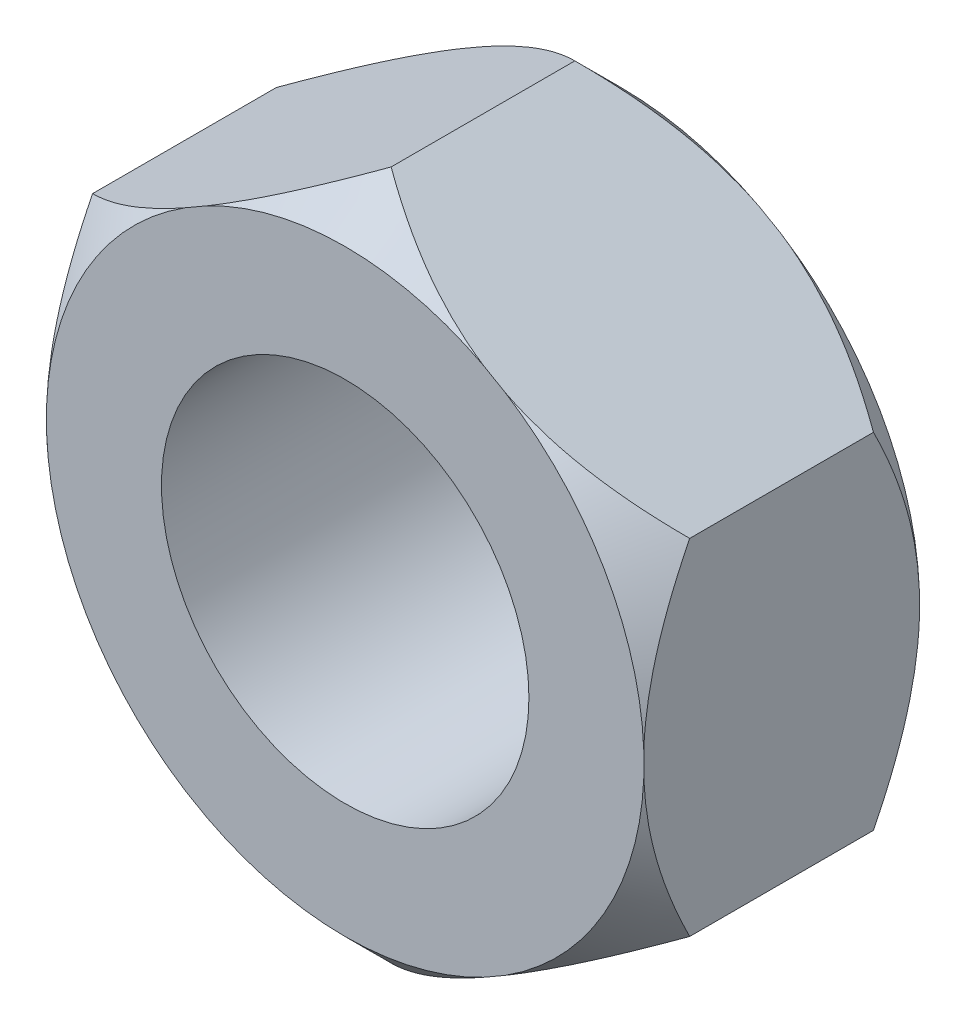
ISO-10303-21;
HEADER;
FILE_DESCRIPTION(('STEP AP214'),'2;1');
FILE_NAME('part.step','',(''),(''),'','','');
FILE_SCHEMA(('AUTOMOTIVE_DESIGN { 1 0 10303 214 1 1 1 1 }'));
ENDSEC;
DATA;
#1=APPLICATION_CONTEXT('core data for automotive mechanical design processes');
#2=APPLICATION_PROTOCOL_DEFINITION('international standard','automotive_design',2000,#1);
#3=PRODUCT_CONTEXT('',#1,'mechanical');
#4=PRODUCT('Part','Part','',(#3));
#5=PRODUCT_RELATED_PRODUCT_CATEGORY('part','',(#4));
#6=PRODUCT_DEFINITION_FORMATION('','',#4);
#7=PRODUCT_DEFINITION_CONTEXT('part definition',#1,'design');
#8=PRODUCT_DEFINITION('design','',#6,#7);
#9=PRODUCT_DEFINITION_SHAPE('','',#8);
#10=(LENGTH_UNIT() NAMED_UNIT(*) SI_UNIT(.MILLI.,.METRE.));
#11=(NAMED_UNIT(*) PLANE_ANGLE_UNIT() SI_UNIT($,.RADIAN.));
#12=(NAMED_UNIT(*) SI_UNIT($,.STERADIAN.) SOLID_ANGLE_UNIT());
#13=UNCERTAINTY_MEASURE_WITH_UNIT(LENGTH_MEASURE(1.E-05),#10,'distance_accuracy_value','');
#14=(GEOMETRIC_REPRESENTATION_CONTEXT(3) GLOBAL_UNCERTAINTY_ASSIGNED_CONTEXT((#13)) GLOBAL_UNIT_ASSIGNED_CONTEXT((#10,
#11,#12)) REPRESENTATION_CONTEXT('',''));
#15=CARTESIAN_POINT('',(0.,0.,0.));
#16=DIRECTION('',(0.,0.,1.));
#17=DIRECTION('',(1.,0.,0.));
#18=AXIS2_PLACEMENT_3D('',#15,#16,#17);
#19=CARTESIAN_POINT('',(6.5,3.75277674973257,-6.));
#20=DIRECTION('',(0.5,0.866025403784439,0.));
#21=DIRECTION('',(-0.866025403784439,0.5,0.));
#22=AXIS2_PLACEMENT_3D('',#19,#20,#21);
#23=PLANE('',#22);
#24=DIRECTION('',(0.,0.,1.));
#25=VECTOR('',#24,1.);
#26=CARTESIAN_POINT('',(6.5,3.75277674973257,-6.));
#27=LINE('',#26,#25);
#28=CARTESIAN_POINT('',(6.5,3.75277674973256,-5.));
#29=VERTEX_POINT('',#28);
#30=CARTESIAN_POINT('',(6.5,3.75277674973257,-1.));
#31=VERTEX_POINT('',#30);
#32=EDGE_CURVE('E173',#29,#31,#27,.T.);
#33=ORIENTED_EDGE('',*,*,#32,.F.);
#34=CARTESIAN_POINT('',(11.0433266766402,1.12968586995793,-1.40459614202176));
#35=CARTESIAN_POINT('',(10.8893769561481,1.21856878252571,-1.54868463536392));
#36=CARTESIAN_POINT('',(10.7348175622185,1.30780369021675,-1.69191243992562));
#37=CARTESIAN_POINT('',(10.4242684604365,1.48709929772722,-1.97631743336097));
#38=CARTESIAN_POINT('',(10.2682786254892,1.57716007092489,-2.11749443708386));
#39=CARTESIAN_POINT('',(9.95431623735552,1.75842634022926,-2.39777201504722));
#40=CARTESIAN_POINT('',(9.79633988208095,1.84963403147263,-2.53686692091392));
#41=CARTESIAN_POINT('',(9.47852692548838,2.0331234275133,-2.81218789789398));
#42=CARTESIAN_POINT('',(9.31869037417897,2.12540510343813,-2.94841404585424));
#43=CARTESIAN_POINT('',(8.99243858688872,2.31376666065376,-3.22115169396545));
#44=CARTESIAN_POINT('',(8.82596338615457,2.40988116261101,-3.35756778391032));
#45=CARTESIAN_POINT('',(8.49038922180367,2.60362499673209,-3.62602381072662));
#46=CARTESIAN_POINT('',(8.32129035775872,2.7012542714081,-3.75806391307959));
#47=CARTESIAN_POINT('',(7.98018538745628,2.89819131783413,-4.01668899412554));
#48=CARTESIAN_POINT('',(7.80818185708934,2.99749760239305,-4.14327848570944));
#49=CARTESIAN_POINT('',(7.46067282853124,3.1981320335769,-4.38985078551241));
#50=CARTESIAN_POINT('',(7.28516777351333,3.29945992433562,-4.50983442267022));
#51=CARTESIAN_POINT('',(6.92532485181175,3.50721533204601,-4.74472132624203));
#52=CARTESIAN_POINT('',(6.74087642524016,3.61370668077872,-4.85940026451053));
#53=CARTESIAN_POINT('',(6.36712480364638,3.82949228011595,-5.07785828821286));
#54=CARTESIAN_POINT('',(6.1778209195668,3.93878692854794,-5.18163581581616));
#55=CARTESIAN_POINT('',(5.794972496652,4.15982456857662,-5.3748771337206));
#56=CARTESIAN_POINT('',(5.60145632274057,4.27155118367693,-5.46441507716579));
#57=CARTESIAN_POINT('',(5.20910252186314,4.49807675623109,-5.62639894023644));
#58=CARTESIAN_POINT('',(5.01026652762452,4.61287477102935,-5.69885003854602));
#59=CARTESIAN_POINT('',(4.64726132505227,4.82245592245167,-5.81072478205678));
#60=CARTESIAN_POINT('',(4.48395020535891,4.91674364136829,-5.85384004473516));
#61=CARTESIAN_POINT('',(4.1548380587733,5.10675662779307,-5.92476075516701));
#62=CARTESIAN_POINT('',(3.98903739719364,5.2024816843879,-5.95256842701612));
#63=CARTESIAN_POINT('',(3.65624818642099,5.39461762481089,-5.99144611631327));
#64=CARTESIAN_POINT('',(3.48926228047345,5.49102698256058,-6.00254587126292));
#65=CARTESIAN_POINT('',(3.1550936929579,5.6839593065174,-6.00749252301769));
#66=CARTESIAN_POINT('',(2.98791100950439,5.78048227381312,-6.00133925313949));
#67=CARTESIAN_POINT('',(2.65509503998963,5.97263366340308,-5.97215863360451));
#68=CARTESIAN_POINT('',(2.48945891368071,6.06826372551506,-5.94917378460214));
#69=CARTESIAN_POINT('',(2.16040109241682,6.25824534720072,-5.88756324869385));
#70=CARTESIAN_POINT('',(1.99697958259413,6.35259679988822,-5.84893626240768));
#71=CARTESIAN_POINT('',(1.67261702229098,6.53986761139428,-5.75763503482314));
#72=CARTESIAN_POINT('',(1.51168500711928,6.63278175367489,-5.7049185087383));
#73=CARTESIAN_POINT('',(1.19319933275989,6.81665954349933,-5.58744691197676));
#74=CARTESIAN_POINT('',(1.03564551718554,6.90762328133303,-5.52269239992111));
#75=CARTESIAN_POINT('',(0.668962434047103,7.11932785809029,-5.35838995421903));
#76=CARTESIAN_POINT('',(0.461254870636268,7.23924787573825,-5.25462806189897));
#77=CARTESIAN_POINT('',(0.0516945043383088,7.47570766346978,-5.03258564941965));
#78=CARTESIAN_POINT('',(-0.150154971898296,7.59224551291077,-4.91429707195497));
#79=CARTESIAN_POINT('',(-0.548975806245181,7.82250482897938,-4.6662133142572));
#80=CARTESIAN_POINT('',(-0.745936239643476,7.93621998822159,-4.53639489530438));
#81=CARTESIAN_POINT('',(-1.1352309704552,8.16097940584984,-4.26796602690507));
#82=CARTESIAN_POINT('',(-1.32756610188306,8.27202414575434,-4.12935717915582));
#83=CARTESIAN_POINT('',(-1.70921572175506,8.49236965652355,-3.84452754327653));
#84=CARTESIAN_POINT('',(-1.89851194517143,8.60165988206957,-3.69827427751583));
#85=CARTESIAN_POINT('',(-2.27376791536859,8.81831401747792,-3.40017211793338));
#86=CARTESIAN_POINT('',(-2.45972754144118,8.92567785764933,-3.24832302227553));
#87=CARTESIAN_POINT('',(-2.82862110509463,9.13865865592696,-2.94027391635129));
#88=CARTESIAN_POINT('',(-3.01155799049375,9.24427731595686,-2.78407859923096));
#89=CARTESIAN_POINT('',(-3.37502372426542,9.45412435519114,-2.46801397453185));
#90=CARTESIAN_POINT('',(-3.55555263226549,9.55835276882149,-2.30814475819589));
#91=CARTESIAN_POINT('',(-3.8711577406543,9.74056746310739,-2.02438976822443));
#92=CARTESIAN_POINT('',(-4.00667031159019,9.8188056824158,-1.90114938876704));
#93=CARTESIAN_POINT('',(-4.27604767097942,9.97433077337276,-1.65368423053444));
#94=CARTESIAN_POINT('',(-4.40991708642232,10.051620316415,-1.52946617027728));
#95=CARTESIAN_POINT('',(-4.54332667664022,10.1286443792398,-1.40459614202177));
#96=B_SPLINE_CURVE_WITH_KNOTS('',3,(#34,#35,#36,#37,#38,#39,#40,#41,#42,#43,#44,#45,#46,#47,#48,
#49,#50,#51,#52,#53,#54,#55,#56,#57,#58,#59,#60,#61,#62,#63,#64,#65,#66,#67,#68,#69,#70,#71,#72,
#73,#74,#75,#76,#77,#78,#79,#80,#81,#82,#83,#84,#85,#86,#87,#88,#89,#90,#91,#92,#93,#94,#95),
.UNSPECIFIED.,.F.,.F.,(4,2,2,2,2,2,2,2,2,2,2,2,2,2,2,2,2,2,2,2,2,2,2,2,2,2,2,2,2,2,4),(0.,
0.686488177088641,1.37303795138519,2.06120340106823,2.749350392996,3.4564439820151,
4.16351080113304,4.86998047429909,5.57636129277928,6.30179544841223,7.02733312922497,
7.74895922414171,8.47036632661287,9.05013970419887,9.62982882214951,10.2084849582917,
10.7871466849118,11.3643522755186,11.9416058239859,12.5206116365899,13.0995905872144,
13.8829026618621,14.6666511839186,15.4520168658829,16.2372398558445,17.0261239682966,
17.8150365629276,18.6031280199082,19.3911999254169,19.9887336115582,20.5836377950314),.UNSPECIFIED.);
#97=CARTESIAN_POINT('',(3.48274395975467,5.49479033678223,-6.));
#98=VERTEX_POINT('',#97);
#99=EDGE_CURVE('E159',#29,#98,#96,.T.);
#100=ORIENTED_EDGE('',*,*,#99,.T.);
#101=DIRECTION('',(-0.866025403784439,0.5,0.));
#102=VECTOR('',#101,1.);
#103=CARTESIAN_POINT('',(6.5,3.75277674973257,-6.));
#104=LINE('',#103,#102);
#105=CARTESIAN_POINT('',(3.01725604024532,5.76353991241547,-6.));
#106=VERTEX_POINT('',#105);
#107=EDGE_CURVE('E171',#98,#106,#104,.T.);
#108=ORIENTED_EDGE('',*,*,#107,.T.);
#109=CARTESIAN_POINT('',(0.,7.50555349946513,-5.));
#110=VERTEX_POINT('',#109);
#111=EDGE_CURVE('E176',#106,#110,#96,.T.);
#112=ORIENTED_EDGE('',*,*,#111,.T.);
#113=DIRECTION('',(0.,0.,1.));
#114=VECTOR('',#113,1.);
#115=CARTESIAN_POINT('',(0.,7.50555349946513,-6.));
#116=LINE('',#115,#114);
#117=CARTESIAN_POINT('',(0.,7.50555349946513,-1.));
#118=VERTEX_POINT('',#117);
#119=EDGE_CURVE('E202',#110,#118,#116,.T.);
#120=ORIENTED_EDGE('',*,*,#119,.T.);
#121=CARTESIAN_POINT('',(-4.54332667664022,10.1286443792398,-4.59540385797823));
#122=CARTESIAN_POINT('',(-4.38937695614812,10.039761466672,-4.45131536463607));
#123=CARTESIAN_POINT('',(-4.23481756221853,9.95052655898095,-4.30808756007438));
#124=CARTESIAN_POINT('',(-3.92426846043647,9.77123095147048,-4.02368256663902));
#125=CARTESIAN_POINT('',(-3.76827862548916,9.68117017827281,-3.88250556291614));
#126=CARTESIAN_POINT('',(-3.45431623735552,9.49990390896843,-3.60222798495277));
#127=CARTESIAN_POINT('',(-3.29633988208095,9.40869621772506,-3.46313307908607));
#128=CARTESIAN_POINT('',(-2.97852692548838,9.22520682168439,-3.18781210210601));
#129=CARTESIAN_POINT('',(-2.81869037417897,9.13292514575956,-3.05158595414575));
#130=CARTESIAN_POINT('',(-2.49243858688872,8.94456358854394,-2.77884830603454));
#131=CARTESIAN_POINT('',(-2.32596338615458,8.84844908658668,-2.64243221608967));
#132=CARTESIAN_POINT('',(-1.99038922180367,8.65470525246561,-2.37397618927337));
#133=CARTESIAN_POINT('',(-1.82129035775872,8.5570759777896,-2.24193608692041));
#134=CARTESIAN_POINT('',(-1.48018538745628,8.36013893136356,-1.98331100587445));
#135=CARTESIAN_POINT('',(-1.30818185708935,8.26083264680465,-1.85672151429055));
#136=CARTESIAN_POINT('',(-0.960672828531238,8.0601982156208,-1.61014921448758));
#137=CARTESIAN_POINT('',(-0.785167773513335,7.95887032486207,-1.49016557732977));
#138=CARTESIAN_POINT('',(-0.425324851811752,7.75111491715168,-1.25527867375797));
#139=CARTESIAN_POINT('',(-0.240876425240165,7.64462356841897,-1.14059973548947));
#140=CARTESIAN_POINT('',(0.132875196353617,7.42883796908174,-0.922141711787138));
#141=CARTESIAN_POINT('',(0.322179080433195,7.31954332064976,-0.818364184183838));
#142=CARTESIAN_POINT('',(0.705027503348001,7.09850568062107,-0.625122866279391));
#143=CARTESIAN_POINT('',(0.898543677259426,6.98677906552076,-0.535584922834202));
#144=CARTESIAN_POINT('',(1.29089747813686,6.76025349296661,-0.373601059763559));
#145=CARTESIAN_POINT('',(1.48973347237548,6.64545547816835,-0.301149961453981));
#146=CARTESIAN_POINT('',(1.85273867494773,6.43587432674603,-0.189275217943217));
#147=CARTESIAN_POINT('',(2.01604979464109,6.34158660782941,-0.146159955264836));
#148=CARTESIAN_POINT('',(2.3451619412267,6.15157362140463,-0.0752392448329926));
#149=CARTESIAN_POINT('',(2.51096260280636,6.05584856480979,-0.0474315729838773));
#150=CARTESIAN_POINT('',(2.84375181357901,5.8637126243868,-0.00855388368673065));
#151=CARTESIAN_POINT('',(3.01073771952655,5.76730326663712,0.00254587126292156));
#152=CARTESIAN_POINT('',(3.3449063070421,5.57437094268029,0.00749252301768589));
#153=CARTESIAN_POINT('',(3.51208899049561,5.47784797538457,0.00133925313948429));
#154=CARTESIAN_POINT('',(3.84490496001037,5.28569658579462,-0.0278413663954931));
#155=CARTESIAN_POINT('',(4.01054108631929,5.19006652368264,-0.0508262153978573));
#156=CARTESIAN_POINT('',(4.33959890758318,5.00008490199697,-0.112436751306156));
#157=CARTESIAN_POINT('',(4.50302041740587,4.90573344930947,-0.151063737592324));
#158=CARTESIAN_POINT('',(4.82738297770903,4.71846263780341,-0.242364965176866));
#159=CARTESIAN_POINT('',(4.98831499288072,4.6255484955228,-0.295081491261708));
#160=CARTESIAN_POINT('',(5.30680066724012,4.44167070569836,-0.412553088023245));
#161=CARTESIAN_POINT('',(5.46435448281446,4.35070696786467,-0.477307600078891));
#162=CARTESIAN_POINT('',(5.8310375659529,4.13900239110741,-0.641610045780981));
#163=CARTESIAN_POINT('',(6.03874512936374,4.01908237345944,-0.745371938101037));
#164=CARTESIAN_POINT('',(6.4483054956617,3.78262258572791,-0.967414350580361));
#165=CARTESIAN_POINT('',(6.65015497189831,3.66608473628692,-1.08570292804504));
#166=CARTESIAN_POINT('',(7.04897580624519,3.43582542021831,-1.33378668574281));
#167=CARTESIAN_POINT('',(7.24593623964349,3.3221102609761,-1.46360510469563));
#168=CARTESIAN_POINT('',(7.63523097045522,3.09735084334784,-1.73203397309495));
#169=CARTESIAN_POINT('',(7.82756610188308,2.98630610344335,-1.87064282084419));
#170=CARTESIAN_POINT('',(8.20921572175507,2.76596059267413,-2.15547245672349));
#171=CARTESIAN_POINT('',(8.39851194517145,2.65667036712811,-2.30172572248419));
#172=CARTESIAN_POINT('',(8.77376791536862,2.44001623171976,-2.59982788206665));
#173=CARTESIAN_POINT('',(8.9597275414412,2.33265239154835,-2.75167697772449));
#174=CARTESIAN_POINT('',(9.32862110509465,2.11967159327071,-3.05972608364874));
#175=CARTESIAN_POINT('',(9.51155799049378,2.01405293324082,-3.21592140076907));
#176=CARTESIAN_POINT('',(9.87502372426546,1.80420589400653,-3.53198602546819));
#177=CARTESIAN_POINT('',(10.0555526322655,1.69997748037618,-3.69185524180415));
#178=CARTESIAN_POINT('',(10.3711577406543,1.51776278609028,-3.9756102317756));
#179=CARTESIAN_POINT('',(10.5066703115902,1.43952456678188,-4.09885061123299));
#180=CARTESIAN_POINT('',(10.7760476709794,1.28399947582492,-4.34631576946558));
#181=CARTESIAN_POINT('',(10.9099170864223,1.20670993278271,-4.47053382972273));
#182=CARTESIAN_POINT('',(11.0433266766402,1.12968586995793,-4.59540385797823));
#183=B_SPLINE_CURVE_WITH_KNOTS('',3,(#121,#122,#123,#124,#125,#126,#127,#128,#129,#130,#131,
#132,#133,#134,#135,#136,#137,#138,#139,#140,#141,#142,#143,#144,#145,#146,#147,#148,#149,#150,
#151,#152,#153,#154,#155,#156,#157,#158,#159,#160,#161,#162,#163,#164,#165,#166,#167,#168,#169,
#170,#171,#172,#173,#174,#175,#176,#177,#178,#179,#180,#181,#182),.UNSPECIFIED.,.F.,.F.,(4,2,2,
2,2,2,2,2,2,2,2,2,2,2,2,2,2,2,2,2,2,2,2,2,2,2,2,2,2,2,4),(0.,0.686488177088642,1.37303795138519,
2.06120340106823,2.749350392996,3.4564439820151,4.16351080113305,4.86998047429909,
5.57636129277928,6.30179544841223,7.02733312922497,7.74895922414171,8.47036632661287,
9.05013970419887,9.62982882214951,10.2084849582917,10.7871466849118,11.3643522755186,
11.9416058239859,12.52061163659,13.0995905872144,13.8829026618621,14.6666511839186,
15.4520168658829,16.2372398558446,17.0261239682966,17.8150365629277,18.6031280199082,
19.3911999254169,19.9887336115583,20.5836377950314),.UNSPECIFIED.);
#184=CARTESIAN_POINT('',(3.01725604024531,5.76353991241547,0.));
#185=VERTEX_POINT('',#184);
#186=EDGE_CURVE('E308',#118,#185,#183,.T.);
#187=ORIENTED_EDGE('',*,*,#186,.T.);
#188=DIRECTION('',(-0.866025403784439,0.5,0.));
#189=VECTOR('',#188,1.);
#190=CARTESIAN_POINT('',(6.5,3.75277674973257,0.));
#191=LINE('',#190,#189);
#192=CARTESIAN_POINT('',(3.48274395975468,5.49479033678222,0.));
#193=VERTEX_POINT('',#192);
#194=EDGE_CURVE('E262',#193,#185,#191,.T.);
#195=ORIENTED_EDGE('',*,*,#194,.F.);
#196=EDGE_CURVE('E271',#193,#31,#183,.T.);
#197=ORIENTED_EDGE('',*,*,#196,.T.);
#198=EDGE_LOOP('',(#33,#100,#108,#112,#120,#187,#195,#197));
#199=FACE_BOUND('',#198,.T.);
#200=ADVANCED_FACE('F32',(#199),#23,.T.);
#201=CARTESIAN_POINT('',(6.5,-3.75277674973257,-6.));
#202=DIRECTION('',(1.,0.,0.));
#203=DIRECTION('',(0.,0.,-1.));
#204=AXIS2_PLACEMENT_3D('',#201,#202,#203);
#205=PLANE('',#204);
#206=DIRECTION('',(0.,0.,1.));
#207=VECTOR('',#206,1.);
#208=CARTESIAN_POINT('',(6.5,-3.75277674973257,-6.));
#209=LINE('',#208,#207);
#210=CARTESIAN_POINT('',(6.5,-3.75277674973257,-5.));
#211=VERTEX_POINT('',#210);
#212=CARTESIAN_POINT('',(6.5,-3.75277674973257,-1.));
#213=VERTEX_POINT('',#212);
#214=EDGE_CURVE('E205',#211,#213,#209,.T.);
#215=ORIENTED_EDGE('',*,*,#214,.F.);
#216=CARTESIAN_POINT('',(6.5,-8.29610342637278,-1.96632525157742));
#217=CARTESIAN_POINT('',(6.5,-8.11036530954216,-2.11250581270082));
#218=CARTESIAN_POINT('',(6.5,-7.92373684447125,-2.25756954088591));
#219=CARTESIAN_POINT('',(6.5,-7.54835509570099,-2.54498409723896));
#220=CARTESIAN_POINT('',(6.5,-7.35960146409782,-2.68733447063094));
#221=CARTESIAN_POINT('',(6.5,-6.97873252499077,-2.96950112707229));
#222=CARTESIAN_POINT('',(6.5,-6.7866050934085,-3.10930108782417));
#223=CARTESIAN_POINT('',(6.5,-6.39953728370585,-3.38493925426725));
#224=CARTESIAN_POINT('',(6.5,-6.20459704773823,-3.52077765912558));
#225=CARTESIAN_POINT('',(6.5,-5.80175036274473,-3.79421885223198));
#226=CARTESIAN_POINT('',(6.5,-5.5936783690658,-3.93157867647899));
#227=CARTESIAN_POINT('',(6.5,-5.17329124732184,-4.19972871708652));
#228=CARTESIAN_POINT('',(6.5,-4.96097565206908,-4.33051820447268));
#229=CARTESIAN_POINT('',(6.5,-4.53185755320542,-4.58357409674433));
#230=CARTESIAN_POINT('',(6.5,-4.31506466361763,-4.70585671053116));
#231=CARTESIAN_POINT('',(6.5,-3.87593140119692,-4.93995118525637));
#232=CARTESIAN_POINT('',(6.5,-3.65359273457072,-5.05176621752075));
#233=CARTESIAN_POINT('',(6.5,-3.22593082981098,-5.25126761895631));
#234=CARTESIAN_POINT('',(6.5,-3.02121813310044,-5.34025315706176));
#235=CARTESIAN_POINT('',(6.5,-2.60646306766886,-5.50502186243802));
#236=CARTESIAN_POINT('',(6.5,-2.39642019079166,-5.58080376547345));
#237=CARTESIAN_POINT('',(6.5,-1.97356357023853,-5.71546630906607));
#238=CARTESIAN_POINT('',(6.5,-1.76080909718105,-5.77453054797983));
#239=CARTESIAN_POINT('',(6.5,-1.33093571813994,-5.87398366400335));
#240=CARTESIAN_POINT('',(6.5,-1.11381737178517,-5.91437492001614));
#241=CARTESIAN_POINT('',(6.5,-0.672554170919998,-5.97457108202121));
#242=CARTESIAN_POINT('',(6.5,-0.448353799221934,-5.99397782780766));
#243=CARTESIAN_POINT('',(6.5,0.00084590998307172,-6.00942901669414));
#244=CARTESIAN_POINT('',(6.5,0.225845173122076,-6.00547558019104));
#245=CARTESIAN_POINT('',(6.5,0.674887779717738,-5.97446419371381));
#246=CARTESIAN_POINT('',(6.5,0.898926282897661,-5.94733749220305));
#247=CARTESIAN_POINT('',(6.5,1.34336613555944,-5.87180698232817));
#248=CARTESIAN_POINT('',(6.5,1.56376649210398,-5.82339746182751));
#249=CARTESIAN_POINT('',(6.5,2.066289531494,-5.69055568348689));
#250=CARTESIAN_POINT('',(6.5,2.34668289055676,-5.59963518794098));
#251=CARTESIAN_POINT('',(6.5,2.89824997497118,-5.39329359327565));
#252=CARTESIAN_POINT('',(6.5,3.16941809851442,-5.27785790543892));
#253=CARTESIAN_POINT('',(6.5,3.70495151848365,-5.02757146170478));
#254=CARTESIAN_POINT('',(6.5,3.96925216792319,-4.89258424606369));
#255=CARTESIAN_POINT('',(6.5,4.49001736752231,-4.60855044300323));
#256=CARTESIAN_POINT('',(6.5,4.74648371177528,-4.45950710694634));
#257=CARTESIAN_POINT('',(6.5,5.29071545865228,-4.1277009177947));
#258=CARTESIAN_POINT('',(6.5,5.57743102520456,-3.9432274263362));
#259=CARTESIAN_POINT('',(6.5,6.14392762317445,-3.56387292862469));
#260=CARTESIAN_POINT('',(6.5,6.42370706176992,-3.36898956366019));
#261=CARTESIAN_POINT('',(6.5,6.97140928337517,-2.97586119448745));
#262=CARTESIAN_POINT('',(6.5,7.23945723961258,-2.77778986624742));
#263=CARTESIAN_POINT('',(6.5,7.63813759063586,-2.47641508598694));
#264=CARTESIAN_POINT('',(6.5,7.77042024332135,-2.37528153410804));
#265=CARTESIAN_POINT('',(6.5,8.0339850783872,-2.17172940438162));
#266=CARTESIAN_POINT('',(6.5,8.16526730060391,-2.06931087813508));
#267=CARTESIAN_POINT('',(6.5,8.29610342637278,-1.96632525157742));
#268=B_SPLINE_CURVE_WITH_KNOTS('',3,(#216,#217,#218,#219,#220,#221,#222,#223,#224,#225,#226,
#227,#228,#229,#230,#231,#232,#233,#234,#235,#236,#237,#238,#239,#240,#241,#242,#243,#244,#245,
#246,#247,#248,#249,#250,#251,#252,#253,#254,#255,#256,#257,#258,#259,#260,#261,#262,#263,#264,
#265,#266,#267),.UNSPECIFIED.,.F.,.F.,(4,2,2,2,2,2,2,2,2,2,2,2,2,2,2,2,2,2,2,2,2,2,2,2,2,4),(0.,
0.709097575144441,1.4183129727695,2.13109111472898,2.84383335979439,3.59170118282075,
4.3396517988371,5.08613586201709,5.83239302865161,6.50167333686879,7.17101769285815,
7.83269743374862,8.49429285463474,9.1682322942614,9.84211056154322,10.5179950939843,
11.1940611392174,12.0768086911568,12.9600830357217,13.8498492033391,14.7394100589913,
15.7619006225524,16.7846238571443,17.7843881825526,18.2839221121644,18.7834360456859),.UNSPECIFIED.);
#269=CARTESIAN_POINT('',(6.5,-0.268749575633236,-6.));
#270=VERTEX_POINT('',#269);
#271=EDGE_CURVE('E354',#211,#270,#268,.T.);
#272=ORIENTED_EDGE('',*,*,#271,.T.);
#273=DIRECTION('',(0.,1.,0.));
#274=VECTOR('',#273,1.);
#275=CARTESIAN_POINT('',(6.5,-3.75277674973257,-6.));
#276=LINE('',#275,#274);
#277=CARTESIAN_POINT('',(6.5,0.268749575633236,-6.));
#278=VERTEX_POINT('',#277);
#279=EDGE_CURVE('E200',#270,#278,#276,.T.);
#280=ORIENTED_EDGE('',*,*,#279,.T.);
#281=EDGE_CURVE('E161',#278,#29,#268,.T.);
#282=ORIENTED_EDGE('',*,*,#281,.T.);
#283=ORIENTED_EDGE('',*,*,#32,.T.);
#284=CARTESIAN_POINT('',(6.5,8.29610342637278,-4.03367474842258));
#285=CARTESIAN_POINT('',(6.5,8.11036530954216,-3.88749418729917));
#286=CARTESIAN_POINT('',(6.5,7.92373684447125,-3.74243045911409));
#287=CARTESIAN_POINT('',(6.5,7.54835509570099,-3.45501590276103));
#288=CARTESIAN_POINT('',(6.5,7.35960146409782,-3.31266552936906));
#289=CARTESIAN_POINT('',(6.5,6.97873252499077,-3.0304988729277));
#290=CARTESIAN_POINT('',(6.5,6.7866050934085,-2.89069891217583));
#291=CARTESIAN_POINT('',(6.5,6.39953728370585,-2.61506074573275));
#292=CARTESIAN_POINT('',(6.5,6.20459704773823,-2.47922234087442));
#293=CARTESIAN_POINT('',(6.5,5.80175036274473,-2.20578114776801));
#294=CARTESIAN_POINT('',(6.5,5.5936783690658,-2.068421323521));
#295=CARTESIAN_POINT('',(6.5,5.17329124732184,-1.80027128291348));
#296=CARTESIAN_POINT('',(6.5,4.96097565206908,-1.66948179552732));
#297=CARTESIAN_POINT('',(6.5,4.53185755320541,-1.41642590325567));
#298=CARTESIAN_POINT('',(6.5,4.31506466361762,-1.29414328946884));
#299=CARTESIAN_POINT('',(6.5,3.87593140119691,-1.06004881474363));
#300=CARTESIAN_POINT('',(6.5,3.65359273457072,-0.948233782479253));
#301=CARTESIAN_POINT('',(6.5,3.22593082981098,-0.748732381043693));
#302=CARTESIAN_POINT('',(6.5,3.02121813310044,-0.659746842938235));
#303=CARTESIAN_POINT('',(6.5,2.60646306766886,-0.494978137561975));
#304=CARTESIAN_POINT('',(6.5,2.39642019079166,-0.419196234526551));
#305=CARTESIAN_POINT('',(6.5,1.97356357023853,-0.284533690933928));
#306=CARTESIAN_POINT('',(6.5,1.76080909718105,-0.225469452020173));
#307=CARTESIAN_POINT('',(6.5,1.33093571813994,-0.126016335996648));
#308=CARTESIAN_POINT('',(6.5,1.11381737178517,-0.0856250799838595));
#309=CARTESIAN_POINT('',(6.5,0.672554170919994,-0.0254289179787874));
#310=CARTESIAN_POINT('',(6.5,0.448353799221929,-0.00602217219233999));
#311=CARTESIAN_POINT('',(6.5,-0.00084590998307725,0.00942901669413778));
#312=CARTESIAN_POINT('',(6.5,-0.225845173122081,0.00547558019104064));
#313=CARTESIAN_POINT('',(6.5,-0.674887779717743,-0.0255358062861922));
#314=CARTESIAN_POINT('',(6.5,-0.898926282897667,-0.0526625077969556));
#315=CARTESIAN_POINT('',(6.5,-1.34336613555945,-0.128193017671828));
#316=CARTESIAN_POINT('',(6.5,-1.56376649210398,-0.176602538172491));
#317=CARTESIAN_POINT('',(6.5,-2.06628953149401,-0.309444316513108));
#318=CARTESIAN_POINT('',(6.5,-2.34668289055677,-0.400364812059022));
#319=CARTESIAN_POINT('',(6.5,-2.89824997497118,-0.606706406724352));
#320=CARTESIAN_POINT('',(6.5,-3.16941809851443,-0.722142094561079));
#321=CARTESIAN_POINT('',(6.5,-3.70495151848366,-0.972428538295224));
#322=CARTESIAN_POINT('',(6.5,-3.9692521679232,-1.10741575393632));
#323=CARTESIAN_POINT('',(6.5,-4.49001736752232,-1.39144955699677));
#324=CARTESIAN_POINT('',(6.5,-4.74648371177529,-1.54049289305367));
#325=CARTESIAN_POINT('',(6.5,-5.29071545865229,-1.87229908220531));
#326=CARTESIAN_POINT('',(6.5,-5.57743102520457,-2.05677257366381));
#327=CARTESIAN_POINT('',(6.5,-6.14392762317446,-2.43612707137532));
#328=CARTESIAN_POINT('',(6.5,-6.42370706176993,-2.63101043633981));
#329=CARTESIAN_POINT('',(6.5,-6.97140928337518,-3.02413880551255));
#330=CARTESIAN_POINT('',(6.5,-7.23945723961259,-3.22221013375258));
#331=CARTESIAN_POINT('',(6.5,-7.63813759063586,-3.52358491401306));
#332=CARTESIAN_POINT('',(6.5,-7.77042024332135,-3.62471846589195));
#333=CARTESIAN_POINT('',(6.5,-8.0339850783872,-3.82827059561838));
#334=CARTESIAN_POINT('',(6.5,-8.16526730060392,-3.93068912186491));
#335=CARTESIAN_POINT('',(6.5,-8.29610342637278,-4.03367474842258));
#336=B_SPLINE_CURVE_WITH_KNOTS('',3,(#284,#285,#286,#287,#288,#289,#290,#291,#292,#293,#294,
#295,#296,#297,#298,#299,#300,#301,#302,#303,#304,#305,#306,#307,#308,#309,#310,#311,#312,#313,
#314,#315,#316,#317,#318,#319,#320,#321,#322,#323,#324,#325,#326,#327,#328,#329,#330,#331,#332,
#333,#334,#335),.UNSPECIFIED.,.F.,.F.,(4,2,2,2,2,2,2,2,2,2,2,2,2,2,2,2,2,2,2,2,2,2,2,2,2,4),(0.,
0.709097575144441,1.4183129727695,2.13109111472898,2.84383335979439,3.59170118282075,
4.3396517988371,5.08613586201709,5.83239302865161,6.50167333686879,7.17101769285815,
7.83269743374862,8.49429285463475,9.16823229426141,9.84211056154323,10.5179950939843,
11.1940611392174,12.0768086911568,12.9600830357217,13.8498492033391,14.7394100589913,
15.7619006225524,16.7846238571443,17.7843881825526,18.2839221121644,18.7834360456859),.UNSPECIFIED.);
#337=CARTESIAN_POINT('',(6.49999999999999,0.268749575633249,0.));
#338=VERTEX_POINT('',#337);
#339=EDGE_CURVE('E277',#31,#338,#336,.T.);
#340=ORIENTED_EDGE('',*,*,#339,.T.);
#341=DIRECTION('',(0.,1.,0.));
#342=VECTOR('',#341,1.);
#343=CARTESIAN_POINT('',(6.5,-3.75277674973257,0.));
#344=LINE('',#343,#342);
#345=CARTESIAN_POINT('',(6.5,-0.268749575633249,0.));
#346=VERTEX_POINT('',#345);
#347=EDGE_CURVE('E182',#346,#338,#344,.T.);
#348=ORIENTED_EDGE('',*,*,#347,.F.);
#349=EDGE_CURVE('E237',#346,#213,#336,.T.);
#350=ORIENTED_EDGE('',*,*,#349,.T.);
#351=EDGE_LOOP('',(#215,#272,#280,#282,#283,#340,#348,#350));
#352=FACE_BOUND('',#351,.T.);
#353=ADVANCED_FACE('F283',(#352),#205,.T.);
#354=CARTESIAN_POINT('',(0.,-7.50555349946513,-6.));
#355=DIRECTION('',(0.5,-0.866025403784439,0.));
#356=DIRECTION('',(0.866025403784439,0.5,0.));
#357=AXIS2_PLACEMENT_3D('',#354,#355,#356);
#358=PLANE('',#357);
#359=DIRECTION('',(0.,0.,1.));
#360=VECTOR('',#359,1.);
#361=CARTESIAN_POINT('',(0.,-7.50555349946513,-6.));
#362=LINE('',#361,#360);
#363=CARTESIAN_POINT('',(0.,-7.50555349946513,-5.));
#364=VERTEX_POINT('',#363);
#365=CARTESIAN_POINT('',(0.,-7.50555349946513,-1.));
#366=VERTEX_POINT('',#365);
#367=EDGE_CURVE('E207',#364,#366,#362,.T.);
#368=ORIENTED_EDGE('',*,*,#367,.F.);
#369=CARTESIAN_POINT('',(-4.54332667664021,-10.1286443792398,-1.40459614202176));
#370=CARTESIAN_POINT('',(-4.38937695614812,-10.039761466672,-1.54868463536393));
#371=CARTESIAN_POINT('',(-4.23481756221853,-9.95052655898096,-1.69191243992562));
#372=CARTESIAN_POINT('',(-3.92426846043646,-9.77123095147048,-1.97631743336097));
#373=CARTESIAN_POINT('',(-3.76827862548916,-9.68117017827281,-2.11749443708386));
#374=CARTESIAN_POINT('',(-3.45431623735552,-9.49990390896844,-2.39777201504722));
#375=CARTESIAN_POINT('',(-3.29633988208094,-9.40869621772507,-2.53686692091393));
#376=CARTESIAN_POINT('',(-2.97852692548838,-9.2252068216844,-2.81218789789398));
#377=CARTESIAN_POINT('',(-2.81869037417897,-9.13292514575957,-2.94841404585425));
#378=CARTESIAN_POINT('',(-2.49243858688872,-8.94456358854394,-3.22115169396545));
#379=CARTESIAN_POINT('',(-2.32596338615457,-8.84844908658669,-3.35756778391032));
#380=CARTESIAN_POINT('',(-1.99038922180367,-8.65470525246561,-3.62602381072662));
#381=CARTESIAN_POINT('',(-1.82129035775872,-8.5570759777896,-3.75806391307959));
#382=CARTESIAN_POINT('',(-1.48018538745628,-8.36013893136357,-4.01668899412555));
#383=CARTESIAN_POINT('',(-1.30818185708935,-8.26083264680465,-4.14327848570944));
#384=CARTESIAN_POINT('',(-0.960672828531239,-8.0601982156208,-4.38985078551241));
#385=CARTESIAN_POINT('',(-0.785167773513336,-7.95887032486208,-4.50983442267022));
#386=CARTESIAN_POINT('',(-0.425324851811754,-7.75111491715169,-4.74472132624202));
#387=CARTESIAN_POINT('',(-0.240876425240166,-7.64462356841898,-4.85940026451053));
#388=CARTESIAN_POINT('',(0.132875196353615,-7.42883796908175,-5.07785828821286));
#389=CARTESIAN_POINT('',(0.322179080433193,-7.31954332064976,-5.18163581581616));
#390=CARTESIAN_POINT('',(0.705027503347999,-7.09850568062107,-5.3748771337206));
#391=CARTESIAN_POINT('',(0.898543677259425,-6.98677906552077,-5.46441507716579));
#392=CARTESIAN_POINT('',(1.29089747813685,-6.76025349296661,-5.62639894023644));
#393=CARTESIAN_POINT('',(1.48973347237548,-6.64545547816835,-5.69885003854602));
#394=CARTESIAN_POINT('',(1.85273867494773,-6.43587432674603,-5.81072478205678));
#395=CARTESIAN_POINT('',(2.01604979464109,-6.34158660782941,-5.85384004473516));
#396=CARTESIAN_POINT('',(2.3451619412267,-6.15157362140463,-5.92476075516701));
#397=CARTESIAN_POINT('',(2.51096260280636,-6.0558485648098,-5.95256842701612));
#398=CARTESIAN_POINT('',(2.843751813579,-5.86371262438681,-5.99144611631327));
#399=CARTESIAN_POINT('',(3.01073771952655,-5.76730326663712,-6.00254587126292));
#400=CARTESIAN_POINT('',(3.3449063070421,-5.5743709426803,-6.00749252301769));
#401=CARTESIAN_POINT('',(3.5120889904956,-5.47784797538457,-6.00133925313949));
#402=CARTESIAN_POINT('',(3.84490496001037,-5.28569658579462,-5.97215863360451));
#403=CARTESIAN_POINT('',(4.01054108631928,-5.19006652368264,-5.94917378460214));
#404=CARTESIAN_POINT('',(4.33959890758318,-5.00008490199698,-5.88756324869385));
#405=CARTESIAN_POINT('',(4.50302041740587,-4.90573344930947,-5.84893626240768));
#406=CARTESIAN_POINT('',(4.82738297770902,-4.71846263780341,-5.75763503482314));
#407=CARTESIAN_POINT('',(4.98831499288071,-4.6255484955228,-5.7049185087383));
#408=CARTESIAN_POINT('',(5.30680066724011,-4.44167070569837,-5.58744691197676));
#409=CARTESIAN_POINT('',(5.46435448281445,-4.35070696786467,-5.52269239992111));
#410=CARTESIAN_POINT('',(5.83103756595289,-4.13900239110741,-5.35838995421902));
#411=CARTESIAN_POINT('',(6.03874512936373,-4.01908237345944,-5.25462806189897));
#412=CARTESIAN_POINT('',(6.44830549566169,-3.78262258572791,-5.03258564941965));
#413=CARTESIAN_POINT('',(6.65015497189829,-3.66608473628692,-4.91429707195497));
#414=CARTESIAN_POINT('',(7.04897580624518,-3.43582542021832,-4.6662133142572));
#415=CARTESIAN_POINT('',(7.24593623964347,-3.32211026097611,-4.53639489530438));
#416=CARTESIAN_POINT('',(7.6352309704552,-3.09735084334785,-4.26796602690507));
#417=CARTESIAN_POINT('',(7.82756610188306,-2.98630610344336,-4.12935717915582));
#418=CARTESIAN_POINT('',(8.20921572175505,-2.76596059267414,-3.84452754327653));
#419=CARTESIAN_POINT('',(8.39851194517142,-2.65667036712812,-3.69827427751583));
#420=CARTESIAN_POINT('',(8.77376791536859,-2.44001623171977,-3.40017211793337));
#421=CARTESIAN_POINT('',(8.95972754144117,-2.33265239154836,-3.24832302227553));
#422=CARTESIAN_POINT('',(9.32862110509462,-2.11967159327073,-2.94027391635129));
#423=CARTESIAN_POINT('',(9.51155799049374,-2.01405293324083,-2.78407859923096));
#424=CARTESIAN_POINT('',(9.87502372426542,-1.80420589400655,-2.46801397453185));
#425=CARTESIAN_POINT('',(10.0555526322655,-1.6999774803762,-2.30814475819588));
#426=CARTESIAN_POINT('',(10.3711577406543,-1.5177627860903,-2.02438976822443));
#427=CARTESIAN_POINT('',(10.5066703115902,-1.43952456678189,-1.90114938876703));
#428=CARTESIAN_POINT('',(10.7760476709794,-1.28399947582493,-1.65368423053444));
#429=CARTESIAN_POINT('',(10.9099170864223,-1.20670993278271,-1.52946617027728));
#430=CARTESIAN_POINT('',(11.0433266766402,-1.12968586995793,-1.40459614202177));
#431=B_SPLINE_CURVE_WITH_KNOTS('',3,(#369,#370,#371,#372,#373,#374,#375,#376,#377,#378,#379,
#380,#381,#382,#383,#384,#385,#386,#387,#388,#389,#390,#391,#392,#393,#394,#395,#396,#397,#398,
#399,#400,#401,#402,#403,#404,#405,#406,#407,#408,#409,#410,#411,#412,#413,#414,#415,#416,#417,
#418,#419,#420,#421,#422,#423,#424,#425,#426,#427,#428,#429,#430),.UNSPECIFIED.,.F.,.F.,(4,2,2,
2,2,2,2,2,2,2,2,2,2,2,2,2,2,2,2,2,2,2,2,2,2,2,2,2,2,2,4),(0.,0.686488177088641,1.37303795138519,
2.06120340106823,2.749350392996,3.4564439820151,4.16351080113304,4.86998047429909,
5.57636129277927,6.30179544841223,7.02733312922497,7.74895922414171,8.47036632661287,
9.05013970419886,9.62982882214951,10.2084849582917,10.7871466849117,11.3643522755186,
11.9416058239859,12.5206116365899,13.0995905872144,13.8829026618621,14.6666511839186,
15.4520168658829,16.2372398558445,17.0261239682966,17.8150365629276,18.6031280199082,
19.3911999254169,19.9887336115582,20.5836377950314),.UNSPECIFIED.);
#432=CARTESIAN_POINT('',(3.01725604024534,-5.76353991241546,-6.));
#433=VERTEX_POINT('',#432);
#434=EDGE_CURVE('E347',#364,#433,#431,.T.);
#435=ORIENTED_EDGE('',*,*,#434,.T.);
#436=DIRECTION('',(0.866025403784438,0.5,0.));
#437=VECTOR('',#436,1.);
#438=CARTESIAN_POINT('',(0.,-7.50555349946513,-6.));
#439=LINE('',#438,#437);
#440=CARTESIAN_POINT('',(3.48274395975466,-5.49479033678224,-6.));
#441=VERTEX_POINT('',#440);
#442=EDGE_CURVE('E197',#433,#441,#439,.T.);
#443=ORIENTED_EDGE('',*,*,#442,.T.);
#444=EDGE_CURVE('E353',#441,#211,#431,.T.);
#445=ORIENTED_EDGE('',*,*,#444,.T.);
#446=ORIENTED_EDGE('',*,*,#214,.T.);
#447=CARTESIAN_POINT('',(11.0433266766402,-1.12968586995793,-4.59540385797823));
#448=CARTESIAN_POINT('',(10.8893769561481,-1.21856878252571,-4.45131536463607));
#449=CARTESIAN_POINT('',(10.7348175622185,-1.30780369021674,-4.30808756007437));
#450=CARTESIAN_POINT('',(10.4242684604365,-1.48709929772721,-4.02368256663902));
#451=CARTESIAN_POINT('',(10.2682786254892,-1.57716007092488,-3.88250556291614));
#452=CARTESIAN_POINT('',(9.95431623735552,-1.75842634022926,-3.60222798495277));
#453=CARTESIAN_POINT('',(9.79633988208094,-1.84963403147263,-3.46313307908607));
#454=CARTESIAN_POINT('',(9.47852692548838,-2.0331234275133,-3.18781210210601));
#455=CARTESIAN_POINT('',(9.31869037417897,-2.12540510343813,-3.05158595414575));
#456=CARTESIAN_POINT('',(8.99243858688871,-2.31376666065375,-2.77884830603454));
#457=CARTESIAN_POINT('',(8.82596338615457,-2.40988116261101,-2.64243221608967));
#458=CARTESIAN_POINT('',(8.49038922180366,-2.60362499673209,-2.37397618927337));
#459=CARTESIAN_POINT('',(8.32129035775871,-2.7012542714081,-2.2419360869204));
#460=CARTESIAN_POINT('',(7.98018538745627,-2.89819131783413,-1.98331100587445));
#461=CARTESIAN_POINT('',(7.80818185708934,-2.99749760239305,-1.85672151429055));
#462=CARTESIAN_POINT('',(7.46067282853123,-3.1981320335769,-1.61014921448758));
#463=CARTESIAN_POINT('',(7.28516777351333,-3.29945992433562,-1.49016557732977));
#464=CARTESIAN_POINT('',(6.92532485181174,-3.50721533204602,-1.25527867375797));
#465=CARTESIAN_POINT('',(6.74087642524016,-3.61370668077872,-1.14059973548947));
#466=CARTESIAN_POINT('',(6.36712480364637,-3.82949228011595,-0.922141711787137));
#467=CARTESIAN_POINT('',(6.1778209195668,-3.93878692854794,-0.818364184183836));
#468=CARTESIAN_POINT('',(5.79497249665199,-4.15982456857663,-0.625122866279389));
#469=CARTESIAN_POINT('',(5.60145632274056,-4.27155118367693,-0.535584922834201));
#470=CARTESIAN_POINT('',(5.20910252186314,-4.49807675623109,-0.373601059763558));
#471=CARTESIAN_POINT('',(5.01026652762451,-4.61287477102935,-0.301149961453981));
#472=CARTESIAN_POINT('',(4.64726132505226,-4.82245592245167,-0.189275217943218));
#473=CARTESIAN_POINT('',(4.4839502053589,-4.91674364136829,-0.146159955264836));
#474=CARTESIAN_POINT('',(4.15483805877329,-5.10675662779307,-0.0752392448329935));
#475=CARTESIAN_POINT('',(3.98903739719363,-5.2024816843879,-0.0474315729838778));
#476=CARTESIAN_POINT('',(3.65624818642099,-5.39461762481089,-0.00855388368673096));
#477=CARTESIAN_POINT('',(3.48926228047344,-5.49102698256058,0.00254587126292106));
#478=CARTESIAN_POINT('',(3.15509369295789,-5.6839593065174,0.00749252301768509));
#479=CARTESIAN_POINT('',(2.98791100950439,-5.78048227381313,0.00133925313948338));
#480=CARTESIAN_POINT('',(2.65509503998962,-5.97263366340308,-0.0278413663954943));
#481=CARTESIAN_POINT('',(2.48945891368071,-6.06826372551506,-0.0508262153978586));
#482=CARTESIAN_POINT('',(2.16040109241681,-6.25824534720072,-0.112436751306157));
#483=CARTESIAN_POINT('',(1.99697958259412,-6.35259679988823,-0.151063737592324));
#484=CARTESIAN_POINT('',(1.67261702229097,-6.53986761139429,-0.242364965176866));
#485=CARTESIAN_POINT('',(1.51168500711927,-6.6327817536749,-0.295081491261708));
#486=CARTESIAN_POINT('',(1.19319933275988,-6.81665954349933,-0.412553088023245));
#487=CARTESIAN_POINT('',(1.03564551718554,-6.90762328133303,-0.477307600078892));
#488=CARTESIAN_POINT('',(0.668962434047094,-7.1193278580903,-0.641610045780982));
#489=CARTESIAN_POINT('',(0.461254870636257,-7.23924787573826,-0.745371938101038));
#490=CARTESIAN_POINT('',(0.0516945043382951,-7.47570766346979,-0.967414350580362));
#491=CARTESIAN_POINT('',(-0.150154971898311,-7.59224551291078,-1.08570292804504));
#492=CARTESIAN_POINT('',(-0.5489758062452,-7.82250482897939,-1.33378668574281));
#493=CARTESIAN_POINT('',(-0.745936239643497,-7.9362199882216,-1.46360510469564));
#494=CARTESIAN_POINT('',(-1.13523097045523,-8.16097940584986,-1.73203397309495));
#495=CARTESIAN_POINT('',(-1.32756610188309,-8.27202414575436,-1.8706428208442));
#496=CARTESIAN_POINT('',(-1.70921572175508,-8.49236965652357,-2.15547245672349));
#497=CARTESIAN_POINT('',(-1.89851194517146,-8.60165988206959,-2.30172572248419));
#498=CARTESIAN_POINT('',(-2.27376791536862,-8.81831401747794,-2.59982788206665));
#499=CARTESIAN_POINT('',(-2.45972754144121,-8.92567785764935,-2.7516769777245));
#500=CARTESIAN_POINT('',(-2.82862110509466,-9.13865865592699,-3.05972608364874));
#501=CARTESIAN_POINT('',(-3.01155799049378,-9.24427731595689,-3.21592140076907));
#502=CARTESIAN_POINT('',(-3.37502372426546,-9.45412435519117,-3.53198602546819));
#503=CARTESIAN_POINT('',(-3.55555263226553,-9.55835276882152,-3.69185524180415));
#504=CARTESIAN_POINT('',(-3.87115774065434,-9.74056746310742,-3.9756102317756));
#505=CARTESIAN_POINT('',(-4.00667031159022,-9.81880568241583,-4.09885061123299));
#506=CARTESIAN_POINT('',(-4.27604767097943,-9.97433077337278,-4.34631576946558));
#507=CARTESIAN_POINT('',(-4.40991708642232,-10.051620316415,-4.47053382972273));
#508=CARTESIAN_POINT('',(-4.54332667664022,-10.1286443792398,-4.59540385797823));
#509=B_SPLINE_CURVE_WITH_KNOTS('',3,(#447,#448,#449,#450,#451,#452,#453,#454,#455,#456,#457,
#458,#459,#460,#461,#462,#463,#464,#465,#466,#467,#468,#469,#470,#471,#472,#473,#474,#475,#476,
#477,#478,#479,#480,#481,#482,#483,#484,#485,#486,#487,#488,#489,#490,#491,#492,#493,#494,#495,
#496,#497,#498,#499,#500,#501,#502,#503,#504,#505,#506,#507,#508),.UNSPECIFIED.,.F.,.F.,(4,2,2,
2,2,2,2,2,2,2,2,2,2,2,2,2,2,2,2,2,2,2,2,2,2,2,2,2,2,2,4),(0.,0.686488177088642,1.37303795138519,
2.06120340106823,2.749350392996,3.4564439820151,4.16351080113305,4.8699804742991,
5.57636129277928,6.30179544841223,7.02733312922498,7.74895922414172,8.47036632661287,
9.05013970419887,9.62982882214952,10.2084849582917,10.7871466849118,11.3643522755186,
11.9416058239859,12.5206116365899,13.0995905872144,13.8829026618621,14.6666511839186,
15.4520168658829,16.2372398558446,17.0261239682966,17.8150365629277,18.6031280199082,
19.3911999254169,19.9887336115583,20.5836377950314),.UNSPECIFIED.);
#510=CARTESIAN_POINT('',(3.48274395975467,-5.49479033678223,0.));
#511=VERTEX_POINT('',#510);
#512=EDGE_CURVE('E235',#213,#511,#509,.T.);
#513=ORIENTED_EDGE('',*,*,#512,.T.);
#514=DIRECTION('',(0.866025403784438,0.5,0.));
#515=VECTOR('',#514,1.);
#516=CARTESIAN_POINT('',(0.,-7.50555349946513,0.));
#517=LINE('',#516,#515);
#518=CARTESIAN_POINT('',(3.01725604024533,-5.76353991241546,0.));
#519=VERTEX_POINT('',#518);
#520=EDGE_CURVE('E188',#519,#511,#517,.T.);
#521=ORIENTED_EDGE('',*,*,#520,.F.);
#522=EDGE_CURVE('E248',#519,#366,#509,.T.);
#523=ORIENTED_EDGE('',*,*,#522,.T.);
#524=EDGE_LOOP('',(#368,#435,#443,#445,#446,#513,#521,#523));
#525=FACE_BOUND('',#524,.T.);
#526=ADVANCED_FACE('F244',(#525),#358,.T.);
#527=CARTESIAN_POINT('',(-6.5,-3.75277674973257,-6.));
#528=DIRECTION('',(-0.5,-0.866025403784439,0.));
#529=DIRECTION('',(0.866025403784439,-0.5,0.));
#530=AXIS2_PLACEMENT_3D('',#527,#528,#529);
#531=PLANE('',#530);
#532=DIRECTION('',(0.,0.,1.));
#533=VECTOR('',#532,1.);
#534=CARTESIAN_POINT('',(-6.5,-3.75277674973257,-6.));
#535=LINE('',#534,#533);
#536=CARTESIAN_POINT('',(-6.5,-3.75277674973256,-5.));
#537=VERTEX_POINT('',#536);
#538=CARTESIAN_POINT('',(-6.5,-3.75277674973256,-1.));
#539=VERTEX_POINT('',#538);
#540=EDGE_CURVE('E209',#537,#539,#535,.T.);
#541=ORIENTED_EDGE('',*,*,#540,.F.);
#542=CARTESIAN_POINT('',(-11.0433266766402,-1.12968586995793,-1.40459614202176));
#543=CARTESIAN_POINT('',(-10.8893769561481,-1.21856878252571,-1.54868463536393));
#544=CARTESIAN_POINT('',(-10.7348175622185,-1.30780369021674,-1.69191243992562));
#545=CARTESIAN_POINT('',(-10.4242684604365,-1.48709929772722,-1.97631743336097));
#546=CARTESIAN_POINT('',(-10.2682786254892,-1.57716007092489,-2.11749443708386));
#547=CARTESIAN_POINT('',(-9.95431623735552,-1.75842634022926,-2.39777201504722));
#548=CARTESIAN_POINT('',(-9.79633988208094,-1.84963403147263,-2.53686692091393));
#549=CARTESIAN_POINT('',(-9.47852692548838,-2.0331234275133,-2.81218789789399));
#550=CARTESIAN_POINT('',(-9.31869037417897,-2.12540510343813,-2.94841404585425));
#551=CARTESIAN_POINT('',(-8.99243858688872,-2.31376666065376,-3.22115169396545));
#552=CARTESIAN_POINT('',(-8.82596338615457,-2.40988116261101,-3.35756778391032));
#553=CARTESIAN_POINT('',(-8.49038922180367,-2.60362499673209,-3.62602381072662));
#554=CARTESIAN_POINT('',(-8.32129035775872,-2.7012542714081,-3.75806391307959));
#555=CARTESIAN_POINT('',(-7.98018538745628,-2.89819131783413,-4.01668899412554));
#556=CARTESIAN_POINT('',(-7.80818185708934,-2.99749760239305,-4.14327848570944));
#557=CARTESIAN_POINT('',(-7.46067282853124,-3.1981320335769,-4.38985078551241));
#558=CARTESIAN_POINT('',(-7.28516777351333,-3.29945992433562,-4.50983442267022));
#559=CARTESIAN_POINT('',(-6.92532485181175,-3.50721533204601,-4.74472132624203));
#560=CARTESIAN_POINT('',(-6.74087642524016,-3.61370668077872,-4.85940026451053));
#561=CARTESIAN_POINT('',(-6.36712480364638,-3.82949228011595,-5.07785828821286));
#562=CARTESIAN_POINT('',(-6.1778209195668,-3.93878692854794,-5.18163581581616));
#563=CARTESIAN_POINT('',(-5.794972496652,-4.15982456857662,-5.3748771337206));
#564=CARTESIAN_POINT('',(-5.60145632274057,-4.27155118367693,-5.46441507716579));
#565=CARTESIAN_POINT('',(-5.20910252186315,-4.49807675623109,-5.62639894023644));
#566=CARTESIAN_POINT('',(-5.01026652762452,-4.61287477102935,-5.69885003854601));
#567=CARTESIAN_POINT('',(-4.64726132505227,-4.82245592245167,-5.81072478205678));
#568=CARTESIAN_POINT('',(-4.48395020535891,-4.91674364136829,-5.85384004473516));
#569=CARTESIAN_POINT('',(-4.1548380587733,-5.10675662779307,-5.924760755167));
#570=CARTESIAN_POINT('',(-3.98903739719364,-5.2024816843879,-5.95256842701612));
#571=CARTESIAN_POINT('',(-3.65624818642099,-5.39461762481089,-5.99144611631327));
#572=CARTESIAN_POINT('',(-3.48926228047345,-5.49102698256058,-6.00254587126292));
#573=CARTESIAN_POINT('',(-3.1550936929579,-5.6839593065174,-6.00749252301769));
#574=CARTESIAN_POINT('',(-2.9879110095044,-5.78048227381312,-6.00133925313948));
#575=CARTESIAN_POINT('',(-2.65509503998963,-5.97263366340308,-5.97215863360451));
#576=CARTESIAN_POINT('',(-2.48945891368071,-6.06826372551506,-5.94917378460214));
#577=CARTESIAN_POINT('',(-2.16040109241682,-6.25824534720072,-5.88756324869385));
#578=CARTESIAN_POINT('',(-1.99697958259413,-6.35259679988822,-5.84893626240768));
#579=CARTESIAN_POINT('',(-1.67261702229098,-6.53986761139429,-5.75763503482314));
#580=CARTESIAN_POINT('',(-1.51168500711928,-6.63278175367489,-5.70491850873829));
#581=CARTESIAN_POINT('',(-1.19319933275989,-6.81665954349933,-5.58744691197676));
#582=CARTESIAN_POINT('',(-1.03564551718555,-6.90762328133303,-5.52269239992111));
#583=CARTESIAN_POINT('',(-0.668962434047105,-7.11932785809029,-5.35838995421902));
#584=CARTESIAN_POINT('',(-0.461254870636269,-7.23924787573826,-5.25462806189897));
#585=CARTESIAN_POINT('',(-0.0516945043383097,-7.47570766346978,-5.03258564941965));
#586=CARTESIAN_POINT('',(0.150154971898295,-7.59224551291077,-4.91429707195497));
#587=CARTESIAN_POINT('',(0.54897580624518,-7.82250482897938,-4.6662133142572));
#588=CARTESIAN_POINT('',(0.745936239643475,-7.93621998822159,-4.53639489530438));
#589=CARTESIAN_POINT('',(1.1352309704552,-8.16097940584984,-4.26796602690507));
#590=CARTESIAN_POINT('',(1.32756610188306,-8.27202414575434,-4.12935717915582));
#591=CARTESIAN_POINT('',(1.70921572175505,-8.49236965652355,-3.84452754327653));
#592=CARTESIAN_POINT('',(1.89851194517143,-8.60165988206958,-3.69827427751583));
#593=CARTESIAN_POINT('',(2.27376791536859,-8.81831401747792,-3.40017211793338));
#594=CARTESIAN_POINT('',(2.45972754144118,-8.92567785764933,-3.24832302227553));
#595=CARTESIAN_POINT('',(2.82862110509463,-9.13865865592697,-2.94027391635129));
#596=CARTESIAN_POINT('',(3.01155799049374,-9.24427731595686,-2.78407859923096));
#597=CARTESIAN_POINT('',(3.37502372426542,-9.45412435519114,-2.46801397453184));
#598=CARTESIAN_POINT('',(3.55555263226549,-9.55835276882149,-2.30814475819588));
#599=CARTESIAN_POINT('',(3.8711577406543,-9.7405674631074,-2.02438976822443));
#600=CARTESIAN_POINT('',(4.00667031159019,-9.81880568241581,-1.90114938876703));
#601=CARTESIAN_POINT('',(4.27604767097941,-9.97433077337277,-1.65368423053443));
#602=CARTESIAN_POINT('',(4.40991708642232,-10.051620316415,-1.52946617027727));
#603=CARTESIAN_POINT('',(4.54332667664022,-10.1286443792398,-1.40459614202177));
#604=B_SPLINE_CURVE_WITH_KNOTS('',3,(#542,#543,#544,#545,#546,#547,#548,#549,#550,#551,#552,
#553,#554,#555,#556,#557,#558,#559,#560,#561,#562,#563,#564,#565,#566,#567,#568,#569,#570,#571,
#572,#573,#574,#575,#576,#577,#578,#579,#580,#581,#582,#583,#584,#585,#586,#587,#588,#589,#590,
#591,#592,#593,#594,#595,#596,#597,#598,#599,#600,#601,#602,#603),.UNSPECIFIED.,.F.,.F.,(4,2,2,
2,2,2,2,2,2,2,2,2,2,2,2,2,2,2,2,2,2,2,2,2,2,2,2,2,2,2,4),(0.,0.686488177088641,1.37303795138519,
2.06120340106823,2.749350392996,3.4564439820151,4.16351080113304,4.86998047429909,
5.57636129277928,6.30179544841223,7.02733312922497,7.74895922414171,8.47036632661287,
9.05013970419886,9.62982882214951,10.2084849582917,10.7871466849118,11.3643522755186,
11.9416058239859,12.5206116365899,13.0995905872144,13.8829026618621,14.6666511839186,
15.4520168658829,16.2372398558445,17.0261239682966,17.8150365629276,18.6031280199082,
19.3911999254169,19.9887336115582,20.5836377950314),.UNSPECIFIED.);
#605=CARTESIAN_POINT('',(-3.48274395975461,-5.49479033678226,-6.));
#606=VERTEX_POINT('',#605);
#607=EDGE_CURVE('E336',#537,#606,#604,.T.);
#608=ORIENTED_EDGE('',*,*,#607,.T.);
#609=DIRECTION('',(0.866025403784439,-0.5,0.));
#610=VECTOR('',#609,1.);
#611=CARTESIAN_POINT('',(-6.5,-3.75277674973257,-6.));
#612=LINE('',#611,#610);
#613=CARTESIAN_POINT('',(-3.01725604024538,-5.76353991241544,-6.));
#614=VERTEX_POINT('',#613);
#615=EDGE_CURVE('E194',#606,#614,#612,.T.);
#616=ORIENTED_EDGE('',*,*,#615,.T.);
#617=EDGE_CURVE('E342',#614,#364,#604,.T.);
#618=ORIENTED_EDGE('',*,*,#617,.T.);
#619=ORIENTED_EDGE('',*,*,#367,.T.);
#620=CARTESIAN_POINT('',(4.54332667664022,-10.1286443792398,-4.59540385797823));
#621=CARTESIAN_POINT('',(4.38937695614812,-10.039761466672,-4.45131536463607));
#622=CARTESIAN_POINT('',(4.23481756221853,-9.95052655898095,-4.30808756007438));
#623=CARTESIAN_POINT('',(3.92426846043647,-9.77123095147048,-4.02368256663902));
#624=CARTESIAN_POINT('',(3.76827862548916,-9.68117017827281,-3.88250556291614));
#625=CARTESIAN_POINT('',(3.45431623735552,-9.49990390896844,-3.60222798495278));
#626=CARTESIAN_POINT('',(3.29633988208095,-9.40869621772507,-3.46313307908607));
#627=CARTESIAN_POINT('',(2.97852692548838,-9.2252068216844,-3.18781210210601));
#628=CARTESIAN_POINT('',(2.81869037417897,-9.13292514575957,-3.05158595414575));
#629=CARTESIAN_POINT('',(2.49243858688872,-8.94456358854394,-2.77884830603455));
#630=CARTESIAN_POINT('',(2.32596338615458,-8.84844908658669,-2.64243221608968));
#631=CARTESIAN_POINT('',(1.99038922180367,-8.65470525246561,-2.37397618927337));
#632=CARTESIAN_POINT('',(1.82129035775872,-8.5570759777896,-2.24193608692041));
#633=CARTESIAN_POINT('',(1.48018538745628,-8.36013893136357,-1.98331100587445));
#634=CARTESIAN_POINT('',(1.30818185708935,-8.26083264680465,-1.85672151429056));
#635=CARTESIAN_POINT('',(0.960672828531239,-8.0601982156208,-1.61014921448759));
#636=CARTESIAN_POINT('',(0.785167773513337,-7.95887032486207,-1.49016557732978));
#637=CARTESIAN_POINT('',(0.425324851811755,-7.75111491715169,-1.25527867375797));
#638=CARTESIAN_POINT('',(0.240876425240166,-7.64462356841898,-1.14059973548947));
#639=CARTESIAN_POINT('',(-0.132875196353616,-7.42883796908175,-0.922141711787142));
#640=CARTESIAN_POINT('',(-0.322179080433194,-7.31954332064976,-0.818364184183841));
#641=CARTESIAN_POINT('',(-0.705027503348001,-7.09850568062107,-0.625122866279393));
#642=CARTESIAN_POINT('',(-0.898543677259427,-6.98677906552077,-0.535584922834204));
#643=CARTESIAN_POINT('',(-1.29089747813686,-6.76025349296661,-0.373601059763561));
#644=CARTESIAN_POINT('',(-1.48973347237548,-6.64545547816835,-0.301149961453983));
#645=CARTESIAN_POINT('',(-1.85273867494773,-6.43587432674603,-0.18927521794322));
#646=CARTESIAN_POINT('',(-2.01604979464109,-6.34158660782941,-0.146159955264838));
#647=CARTESIAN_POINT('',(-2.3451619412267,-6.15157362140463,-0.0752392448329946));
#648=CARTESIAN_POINT('',(-2.51096260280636,-6.0558485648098,-0.0474315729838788));
#649=CARTESIAN_POINT('',(-2.84375181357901,-5.86371262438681,-0.00855388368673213));
#650=CARTESIAN_POINT('',(-3.01073771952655,-5.76730326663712,0.00254587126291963));
#651=CARTESIAN_POINT('',(-3.3449063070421,-5.5743709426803,0.00749252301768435));
#652=CARTESIAN_POINT('',(-3.51208899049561,-5.47784797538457,0.00133925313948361));
#653=CARTESIAN_POINT('',(-3.84490496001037,-5.28569658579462,-0.0278413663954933));
#654=CARTESIAN_POINT('',(-4.01054108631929,-5.19006652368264,-0.0508262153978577));
#655=CARTESIAN_POINT('',(-4.33959890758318,-5.00008490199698,-0.112436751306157));
#656=CARTESIAN_POINT('',(-4.50302041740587,-4.90573344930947,-0.151063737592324));
#657=CARTESIAN_POINT('',(-4.82738297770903,-4.71846263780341,-0.242364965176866));
#658=CARTESIAN_POINT('',(-4.98831499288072,-4.6255484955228,-0.295081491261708));
#659=CARTESIAN_POINT('',(-5.30680066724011,-4.44167070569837,-0.412553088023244));
#660=CARTESIAN_POINT('',(-5.46435448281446,-4.35070696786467,-0.477307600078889));
#661=CARTESIAN_POINT('',(-5.8310375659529,-4.13900239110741,-0.641610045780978));
#662=CARTESIAN_POINT('',(-6.03874512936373,-4.01908237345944,-0.745371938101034));
#663=CARTESIAN_POINT('',(-6.44830549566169,-3.78262258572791,-0.967414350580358));
#664=CARTESIAN_POINT('',(-6.6501549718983,-3.66608473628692,-1.08570292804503));
#665=CARTESIAN_POINT('',(-7.04897580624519,-3.43582542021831,-1.33378668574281));
#666=CARTESIAN_POINT('',(-7.24593623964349,-3.3221102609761,-1.46360510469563));
#667=CARTESIAN_POINT('',(-7.63523097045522,-3.09735084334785,-1.73203397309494));
#668=CARTESIAN_POINT('',(-7.82756610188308,-2.98630610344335,-1.87064282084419));
#669=CARTESIAN_POINT('',(-8.20921572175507,-2.76596059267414,-2.15547245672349));
#670=CARTESIAN_POINT('',(-8.39851194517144,-2.65667036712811,-2.30172572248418));
#671=CARTESIAN_POINT('',(-8.77376791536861,-2.44001623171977,-2.59982788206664));
#672=CARTESIAN_POINT('',(-8.95972754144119,-2.33265239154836,-2.75167697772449));
#673=CARTESIAN_POINT('',(-9.32862110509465,-2.11967159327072,-3.05972608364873));
#674=CARTESIAN_POINT('',(-9.51155799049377,-2.01405293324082,-3.21592140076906));
#675=CARTESIAN_POINT('',(-9.87502372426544,-1.80420589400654,-3.53198602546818));
#676=CARTESIAN_POINT('',(-10.0555526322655,-1.69997748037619,-3.69185524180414));
#677=CARTESIAN_POINT('',(-10.3711577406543,-1.51776278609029,-3.97561023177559));
#678=CARTESIAN_POINT('',(-10.5066703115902,-1.43952456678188,-4.09885061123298));
#679=CARTESIAN_POINT('',(-10.7760476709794,-1.28399947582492,-4.34631576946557));
#680=CARTESIAN_POINT('',(-10.9099170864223,-1.20670993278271,-4.47053382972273));
#681=CARTESIAN_POINT('',(-11.0433266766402,-1.12968586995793,-4.59540385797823));
#682=B_SPLINE_CURVE_WITH_KNOTS('',3,(#620,#621,#622,#623,#624,#625,#626,#627,#628,#629,#630,
#631,#632,#633,#634,#635,#636,#637,#638,#639,#640,#641,#642,#643,#644,#645,#646,#647,#648,#649,
#650,#651,#652,#653,#654,#655,#656,#657,#658,#659,#660,#661,#662,#663,#664,#665,#666,#667,#668,
#669,#670,#671,#672,#673,#674,#675,#676,#677,#678,#679,#680,#681),.UNSPECIFIED.,.F.,.F.,(4,2,2,
2,2,2,2,2,2,2,2,2,2,2,2,2,2,2,2,2,2,2,2,2,2,2,2,2,2,2,4),(0.,0.686488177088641,1.37303795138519,
2.06120340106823,2.749350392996,3.45644398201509,4.16351080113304,4.86998047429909,
5.57636129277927,6.30179544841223,7.02733312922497,7.74895922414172,8.47036632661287,
9.05013970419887,9.62982882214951,10.2084849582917,10.7871466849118,11.3643522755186,
11.9416058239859,12.5206116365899,13.0995905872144,13.8829026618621,14.6666511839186,
15.4520168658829,16.2372398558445,17.0261239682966,17.8150365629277,18.6031280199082,
19.3911999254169,19.9887336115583,20.5836377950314),.UNSPECIFIED.);
#683=CARTESIAN_POINT('',(-3.01725604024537,-5.76353991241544,0.));
#684=VERTEX_POINT('',#683);
#685=EDGE_CURVE('E325',#366,#684,#682,.T.);
#686=ORIENTED_EDGE('',*,*,#685,.T.);
#687=DIRECTION('',(0.866025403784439,-0.5,0.));
#688=VECTOR('',#687,1.);
#689=CARTESIAN_POINT('',(-6.5,-3.75277674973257,0.));
#690=LINE('',#689,#688);
#691=CARTESIAN_POINT('',(-3.48274395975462,-5.49479033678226,0.));
#692=VERTEX_POINT('',#691);
#693=EDGE_CURVE('E253',#692,#684,#690,.T.);
#694=ORIENTED_EDGE('',*,*,#693,.F.);
#695=EDGE_CURVE('E319',#692,#539,#682,.T.);
#696=ORIENTED_EDGE('',*,*,#695,.T.);
#697=EDGE_LOOP('',(#541,#608,#616,#618,#619,#686,#694,#696));
#698=FACE_BOUND('',#697,.T.);
#699=ADVANCED_FACE('F327',(#698),#531,.T.);
#700=CARTESIAN_POINT('',(-6.5,3.75277674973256,-6.));
#701=DIRECTION('',(-1.,0.,0.));
#702=DIRECTION('',(0.,-1.,0.));
#703=AXIS2_PLACEMENT_3D('',#700,#701,#702);
#704=PLANE('',#703);
#705=DIRECTION('',(0.,0.,1.));
#706=VECTOR('',#705,1.);
#707=CARTESIAN_POINT('',(-6.5,3.75277674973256,-6.));
#708=LINE('',#707,#706);
#709=CARTESIAN_POINT('',(-6.49999999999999,3.75277674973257,-5.));
#710=VERTEX_POINT('',#709);
#711=CARTESIAN_POINT('',(-6.5,3.75277674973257,-1.));
#712=VERTEX_POINT('',#711);
#713=EDGE_CURVE('E211',#710,#712,#708,.T.);
#714=ORIENTED_EDGE('',*,*,#713,.F.);
#715=CARTESIAN_POINT('',(-6.5,8.29610342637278,-1.96632525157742));
#716=CARTESIAN_POINT('',(-6.5,8.11036530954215,-2.11250581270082));
#717=CARTESIAN_POINT('',(-6.5,7.92373684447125,-2.25756954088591));
#718=CARTESIAN_POINT('',(-6.5,7.54835509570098,-2.54498409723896));
#719=CARTESIAN_POINT('',(-6.5,7.35960146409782,-2.68733447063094));
#720=CARTESIAN_POINT('',(-6.5,6.97873252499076,-2.96950112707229));
#721=CARTESIAN_POINT('',(-6.5,6.7866050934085,-3.10930108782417));
#722=CARTESIAN_POINT('',(-6.5,6.39953728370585,-3.38493925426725));
#723=CARTESIAN_POINT('',(-6.5,6.20459704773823,-3.52077765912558));
#724=CARTESIAN_POINT('',(-6.5,5.80175036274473,-3.79421885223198));
#725=CARTESIAN_POINT('',(-6.5,5.59367836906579,-3.93157867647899));
#726=CARTESIAN_POINT('',(-6.5,5.17329124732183,-4.19972871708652));
#727=CARTESIAN_POINT('',(-6.5,4.96097565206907,-4.33051820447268));
#728=CARTESIAN_POINT('',(-6.5,4.53185755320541,-4.58357409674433));
#729=CARTESIAN_POINT('',(-6.5,4.31506466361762,-4.70585671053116));
#730=CARTESIAN_POINT('',(-6.5,3.87593140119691,-4.93995118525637));
#731=CARTESIAN_POINT('',(-6.5,3.65359273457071,-5.05176621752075));
#732=CARTESIAN_POINT('',(-6.5,3.22593082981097,-5.25126761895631));
#733=CARTESIAN_POINT('',(-6.5,3.02121813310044,-5.34025315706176));
#734=CARTESIAN_POINT('',(-6.5,2.60646306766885,-5.50502186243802));
#735=CARTESIAN_POINT('',(-6.5,2.39642019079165,-5.58080376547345));
#736=CARTESIAN_POINT('',(-6.5,1.97356357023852,-5.71546630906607));
#737=CARTESIAN_POINT('',(-6.5,1.76080909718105,-5.77453054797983));
#738=CARTESIAN_POINT('',(-6.5,1.33093571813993,-5.87398366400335));
#739=CARTESIAN_POINT('',(-6.5,1.11381737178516,-5.91437492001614));
#740=CARTESIAN_POINT('',(-6.5,0.672554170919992,-5.97457108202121));
#741=CARTESIAN_POINT('',(-6.5,0.448353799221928,-5.99397782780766));
#742=CARTESIAN_POINT('',(-6.5,-0.000845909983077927,-6.00942901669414));
#743=CARTESIAN_POINT('',(-6.5,-0.225845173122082,-6.00547558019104));
#744=CARTESIAN_POINT('',(-6.5,-0.674887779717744,-5.97446419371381));
#745=CARTESIAN_POINT('',(-6.5,-0.898926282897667,-5.94733749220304));
#746=CARTESIAN_POINT('',(-6.5,-1.34336613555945,-5.87180698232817));
#747=CARTESIAN_POINT('',(-6.5,-1.56376649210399,-5.82339746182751));
#748=CARTESIAN_POINT('',(-6.5,-2.06628953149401,-5.69055568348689));
#749=CARTESIAN_POINT('',(-6.5,-2.34668289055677,-5.59963518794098));
#750=CARTESIAN_POINT('',(-6.5,-2.89824997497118,-5.39329359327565));
#751=CARTESIAN_POINT('',(-6.5,-3.16941809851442,-5.27785790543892));
#752=CARTESIAN_POINT('',(-6.5,-3.70495151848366,-5.02757146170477));
#753=CARTESIAN_POINT('',(-6.5,-3.9692521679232,-4.89258424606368));
#754=CARTESIAN_POINT('',(-6.5,-4.49001736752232,-4.60855044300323));
#755=CARTESIAN_POINT('',(-6.5,-4.74648371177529,-4.45950710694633));
#756=CARTESIAN_POINT('',(-6.5,-5.29071545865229,-4.12770091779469));
#757=CARTESIAN_POINT('',(-6.5,-5.57743102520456,-3.94322742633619));
#758=CARTESIAN_POINT('',(-6.5,-6.14392762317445,-3.56387292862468));
#759=CARTESIAN_POINT('',(-6.5,-6.42370706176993,-3.36898956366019));
#760=CARTESIAN_POINT('',(-6.5,-6.97140928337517,-2.97586119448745));
#761=CARTESIAN_POINT('',(-6.5,-7.23945723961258,-2.77778986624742));
#762=CARTESIAN_POINT('',(-6.5,-7.63813759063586,-2.47641508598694));
#763=CARTESIAN_POINT('',(-6.5,-7.77042024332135,-2.37528153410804));
#764=CARTESIAN_POINT('',(-6.5,-8.0339850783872,-2.17172940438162));
#765=CARTESIAN_POINT('',(-6.5,-8.16526730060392,-2.06931087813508));
#766=CARTESIAN_POINT('',(-6.5,-8.29610342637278,-1.96632525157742));
#767=B_SPLINE_CURVE_WITH_KNOTS('',3,(#715,#716,#717,#718,#719,#720,#721,#722,#723,#724,#725,
#726,#727,#728,#729,#730,#731,#732,#733,#734,#735,#736,#737,#738,#739,#740,#741,#742,#743,#744,
#745,#746,#747,#748,#749,#750,#751,#752,#753,#754,#755,#756,#757,#758,#759,#760,#761,#762,#763,
#764,#765,#766),.UNSPECIFIED.,.F.,.F.,(4,2,2,2,2,2,2,2,2,2,2,2,2,2,2,2,2,2,2,2,2,2,2,2,2,4),(0.,
0.709097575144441,1.4183129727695,2.13109111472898,2.84383335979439,3.59170118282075,
4.3396517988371,5.08613586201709,5.83239302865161,6.5016733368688,7.17101769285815,
7.83269743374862,8.49429285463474,9.16823229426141,9.84211056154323,10.5179950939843,
11.1940611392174,12.0768086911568,12.9600830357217,13.8498492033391,14.7394100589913,
15.7619006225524,16.7846238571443,17.7843881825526,18.2839221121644,18.7834360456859),.UNSPECIFIED.);
#768=CARTESIAN_POINT('',(-6.5,0.268749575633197,-6.));
#769=VERTEX_POINT('',#768);
#770=EDGE_CURVE('E428',#710,#769,#767,.T.);
#771=ORIENTED_EDGE('',*,*,#770,.T.);
#772=DIRECTION('',(0.,-1.,0.));
#773=VECTOR('',#772,1.);
#774=CARTESIAN_POINT('',(-6.5,3.75277674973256,-6.));
#775=LINE('',#774,#773);
#776=CARTESIAN_POINT('',(-6.5,-0.2687495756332,-6.));
#777=VERTEX_POINT('',#776);
#778=EDGE_CURVE('E185',#769,#777,#775,.T.);
#779=ORIENTED_EDGE('',*,*,#778,.T.);
#780=EDGE_CURVE('E55',#777,#537,#767,.T.);
#781=ORIENTED_EDGE('',*,*,#780,.T.);
#782=ORIENTED_EDGE('',*,*,#540,.T.);
#783=CARTESIAN_POINT('',(-6.5,-8.29610342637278,-4.03367474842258));
#784=CARTESIAN_POINT('',(-6.5,-8.11036530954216,-3.88749418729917));
#785=CARTESIAN_POINT('',(-6.5,-7.92373684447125,-3.74243045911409));
#786=CARTESIAN_POINT('',(-6.5,-7.54835509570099,-3.45501590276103));
#787=CARTESIAN_POINT('',(-6.5,-7.35960146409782,-3.31266552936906));
#788=CARTESIAN_POINT('',(-6.5,-6.97873252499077,-3.0304988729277));
#789=CARTESIAN_POINT('',(-6.5,-6.7866050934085,-2.89069891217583));
#790=CARTESIAN_POINT('',(-6.5,-6.39953728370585,-2.61506074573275));
#791=CARTESIAN_POINT('',(-6.5,-6.20459704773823,-2.47922234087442));
#792=CARTESIAN_POINT('',(-6.5,-5.80175036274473,-2.20578114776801));
#793=CARTESIAN_POINT('',(-6.5,-5.5936783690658,-2.06842132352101));
#794=CARTESIAN_POINT('',(-6.5,-5.17329124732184,-1.80027128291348));
#795=CARTESIAN_POINT('',(-6.5,-4.96097565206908,-1.66948179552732));
#796=CARTESIAN_POINT('',(-6.5,-4.53185755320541,-1.41642590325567));
#797=CARTESIAN_POINT('',(-6.5,-4.31506466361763,-1.29414328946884));
#798=CARTESIAN_POINT('',(-6.5,-3.87593140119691,-1.06004881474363));
#799=CARTESIAN_POINT('',(-6.5,-3.65359273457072,-0.948233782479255));
#800=CARTESIAN_POINT('',(-6.5,-3.22593082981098,-0.748732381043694));
#801=CARTESIAN_POINT('',(-6.5,-3.02121813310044,-0.659746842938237));
#802=CARTESIAN_POINT('',(-6.5,-2.60646306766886,-0.494978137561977));
#803=CARTESIAN_POINT('',(-6.5,-2.39642019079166,-0.419196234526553));
#804=CARTESIAN_POINT('',(-6.5,-1.97356357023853,-0.284533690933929));
#805=CARTESIAN_POINT('',(-6.5,-1.76080909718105,-0.225469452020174));
#806=CARTESIAN_POINT('',(-6.5,-1.33093571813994,-0.12601633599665));
#807=CARTESIAN_POINT('',(-6.5,-1.11381737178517,-0.0856250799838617));
#808=CARTESIAN_POINT('',(-6.5,-0.672554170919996,-0.0254289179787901));
#809=CARTESIAN_POINT('',(-6.5,-0.448353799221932,-0.00602217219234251));
#810=CARTESIAN_POINT('',(-6.5,0.000845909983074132,0.00942901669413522));
#811=CARTESIAN_POINT('',(-6.5,0.225845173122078,0.00547558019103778));
#812=CARTESIAN_POINT('',(-6.5,0.674887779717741,-0.0255358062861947));
#813=CARTESIAN_POINT('',(-6.5,0.898926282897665,-0.0526625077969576));
#814=CARTESIAN_POINT('',(-6.5,1.34336613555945,-0.12819301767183));
#815=CARTESIAN_POINT('',(-6.5,1.56376649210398,-0.176602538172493));
#816=CARTESIAN_POINT('',(-6.5,2.06628953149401,-0.30944431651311));
#817=CARTESIAN_POINT('',(-6.5,2.34668289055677,-0.400364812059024));
#818=CARTESIAN_POINT('',(-6.5,2.89824997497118,-0.606706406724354));
#819=CARTESIAN_POINT('',(-6.5,3.16941809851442,-0.722142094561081));
#820=CARTESIAN_POINT('',(-6.5,3.70495151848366,-0.972428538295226));
#821=CARTESIAN_POINT('',(-6.5,3.9692521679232,-1.10741575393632));
#822=CARTESIAN_POINT('',(-6.5,4.49001736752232,-1.39144955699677));
#823=CARTESIAN_POINT('',(-6.5,4.74648371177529,-1.54049289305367));
#824=CARTESIAN_POINT('',(-6.5,5.29071545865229,-1.87229908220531));
#825=CARTESIAN_POINT('',(-6.5,5.57743102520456,-2.05677257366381));
#826=CARTESIAN_POINT('',(-6.5,6.14392762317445,-2.43612707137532));
#827=CARTESIAN_POINT('',(-6.5,6.42370706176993,-2.63101043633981));
#828=CARTESIAN_POINT('',(-6.5,6.97140928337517,-3.02413880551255));
#829=CARTESIAN_POINT('',(-6.5,7.23945723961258,-3.22221013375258));
#830=CARTESIAN_POINT('',(-6.5,7.63813759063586,-3.52358491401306));
#831=CARTESIAN_POINT('',(-6.5,7.77042024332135,-3.62471846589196));
#832=CARTESIAN_POINT('',(-6.5,8.0339850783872,-3.82827059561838));
#833=CARTESIAN_POINT('',(-6.5,8.16526730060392,-3.93068912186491));
#834=CARTESIAN_POINT('',(-6.5,8.29610342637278,-4.03367474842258));
#835=B_SPLINE_CURVE_WITH_KNOTS('',3,(#783,#784,#785,#786,#787,#788,#789,#790,#791,#792,#793,
#794,#795,#796,#797,#798,#799,#800,#801,#802,#803,#804,#805,#806,#807,#808,#809,#810,#811,#812,
#813,#814,#815,#816,#817,#818,#819,#820,#821,#822,#823,#824,#825,#826,#827,#828,#829,#830,#831,
#832,#833,#834),.UNSPECIFIED.,.F.,.F.,(4,2,2,2,2,2,2,2,2,2,2,2,2,2,2,2,2,2,2,2,2,2,2,2,2,4),(0.,
0.709097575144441,1.4183129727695,2.13109111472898,2.84383335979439,3.59170118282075,
4.3396517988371,5.08613586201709,5.83239302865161,6.50167333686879,7.17101769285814,
7.83269743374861,8.49429285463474,9.1682322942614,9.84211056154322,10.5179950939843,
11.1940611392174,12.0768086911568,12.9600830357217,13.8498492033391,14.7394100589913,
15.7619006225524,16.7846238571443,17.7843881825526,18.2839221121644,18.7834360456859),.UNSPECIFIED.);
#836=CARTESIAN_POINT('',(-6.5,-0.268749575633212,0.));
#837=VERTEX_POINT('',#836);
#838=EDGE_CURVE('E326',#539,#837,#835,.T.);
#839=ORIENTED_EDGE('',*,*,#838,.T.);
#840=DIRECTION('',(0.,-1.,0.));
#841=VECTOR('',#840,1.);
#842=CARTESIAN_POINT('',(-6.5,3.75277674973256,0.));
#843=LINE('',#842,#841);
#844=CARTESIAN_POINT('',(-6.5,0.268749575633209,0.));
#845=VERTEX_POINT('',#844);
#846=EDGE_CURVE('E254',#845,#837,#843,.T.);
#847=ORIENTED_EDGE('',*,*,#846,.F.);
#848=EDGE_CURVE('E314',#845,#712,#835,.T.);
#849=ORIENTED_EDGE('',*,*,#848,.T.);
#850=EDGE_LOOP('',(#714,#771,#779,#781,#782,#839,#847,#849));
#851=FACE_BOUND('',#850,.T.);
#852=ADVANCED_FACE('F330',(#851),#704,.T.);
#853=CARTESIAN_POINT('',(0.,7.50555349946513,-6.));
#854=DIRECTION('',(-0.5,0.866025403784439,0.));
#855=DIRECTION('',(-0.866025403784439,-0.5,0.));
#856=AXIS2_PLACEMENT_3D('',#853,#854,#855);
#857=PLANE('',#856);
#858=ORIENTED_EDGE('',*,*,#119,.F.);
#859=CARTESIAN_POINT('',(4.54332667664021,10.1286443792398,-1.40459614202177));
#860=CARTESIAN_POINT('',(4.38937695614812,10.039761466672,-1.54868463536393));
#861=CARTESIAN_POINT('',(4.23481756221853,9.95052655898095,-1.69191243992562));
#862=CARTESIAN_POINT('',(3.92426846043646,9.77123095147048,-1.97631743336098));
#863=CARTESIAN_POINT('',(3.76827862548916,9.68117017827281,-2.11749443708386));
#864=CARTESIAN_POINT('',(3.45431623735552,9.49990390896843,-2.39777201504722));
#865=CARTESIAN_POINT('',(3.29633988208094,9.40869621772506,-2.53686692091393));
#866=CARTESIAN_POINT('',(2.97852692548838,9.2252068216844,-2.81218789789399));
#867=CARTESIAN_POINT('',(2.81869037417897,9.13292514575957,-2.94841404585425));
#868=CARTESIAN_POINT('',(2.49243858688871,8.94456358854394,-3.22115169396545));
#869=CARTESIAN_POINT('',(2.32596338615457,8.84844908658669,-3.35756778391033));
#870=CARTESIAN_POINT('',(1.99038922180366,8.65470525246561,-3.62602381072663));
#871=CARTESIAN_POINT('',(1.82129035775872,8.5570759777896,-3.75806391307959));
#872=CARTESIAN_POINT('',(1.48018538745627,8.36013893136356,-4.01668899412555));
#873=CARTESIAN_POINT('',(1.30818185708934,8.26083264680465,-4.14327848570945));
#874=CARTESIAN_POINT('',(0.960672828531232,8.0601982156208,-4.38985078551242));
#875=CARTESIAN_POINT('',(0.785167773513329,7.95887032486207,-4.50983442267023));
#876=CARTESIAN_POINT('',(0.425324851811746,7.75111491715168,-4.74472132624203));
#877=CARTESIAN_POINT('',(0.240876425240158,7.64462356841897,-4.85940026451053));
#878=CARTESIAN_POINT('',(-0.132875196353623,7.42883796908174,-5.07785828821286));
#879=CARTESIAN_POINT('',(-0.322179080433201,7.31954332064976,-5.18163581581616));
#880=CARTESIAN_POINT('',(-0.705027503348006,7.09850568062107,-5.37487713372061));
#881=CARTESIAN_POINT('',(-0.898543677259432,6.98677906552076,-5.4644150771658));
#882=CARTESIAN_POINT('',(-1.29089747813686,6.76025349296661,-5.62639894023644));
#883=CARTESIAN_POINT('',(-1.48973347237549,6.64545547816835,-5.69885003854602));
#884=CARTESIAN_POINT('',(-1.85273867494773,6.43587432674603,-5.81072478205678));
#885=CARTESIAN_POINT('',(-2.01604979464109,6.34158660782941,-5.85384004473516));
#886=CARTESIAN_POINT('',(-2.34516194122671,6.15157362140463,-5.92476075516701));
#887=CARTESIAN_POINT('',(-2.51096260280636,6.05584856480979,-5.95256842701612));
#888=CARTESIAN_POINT('',(-2.84375181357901,5.8637126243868,-5.99144611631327));
#889=CARTESIAN_POINT('',(-3.01073771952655,5.76730326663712,-6.00254587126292));
#890=CARTESIAN_POINT('',(-3.34490630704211,5.5743709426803,-6.00749252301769));
#891=CARTESIAN_POINT('',(-3.51208899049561,5.47784797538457,-6.00133925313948));
#892=CARTESIAN_POINT('',(-3.84490496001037,5.28569658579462,-5.97215863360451));
#893=CARTESIAN_POINT('',(-4.01054108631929,5.19006652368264,-5.94917378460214));
#894=CARTESIAN_POINT('',(-4.33959890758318,5.00008490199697,-5.88756324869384));
#895=CARTESIAN_POINT('',(-4.50302041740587,4.90573344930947,-5.84893626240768));
#896=CARTESIAN_POINT('',(-4.82738297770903,4.71846263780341,-5.75763503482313));
#897=CARTESIAN_POINT('',(-4.98831499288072,4.6255484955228,-5.70491850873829));
#898=CARTESIAN_POINT('',(-5.30680066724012,4.44167070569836,-5.58744691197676));
#899=CARTESIAN_POINT('',(-5.46435448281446,4.35070696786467,-5.52269239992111));
#900=CARTESIAN_POINT('',(-5.8310375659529,4.1390023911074,-5.35838995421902));
#901=CARTESIAN_POINT('',(-6.03874512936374,4.01908237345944,-5.25462806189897));
#902=CARTESIAN_POINT('',(-6.4483054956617,3.78262258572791,-5.03258564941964));
#903=CARTESIAN_POINT('',(-6.6501549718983,3.66608473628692,-4.91429707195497));
#904=CARTESIAN_POINT('',(-7.04897580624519,3.43582542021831,-4.66621331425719));
#905=CARTESIAN_POINT('',(-7.24593623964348,3.3221102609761,-4.53639489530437));
#906=CARTESIAN_POINT('',(-7.63523097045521,3.09735084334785,-4.26796602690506));
#907=CARTESIAN_POINT('',(-7.82756610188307,2.98630610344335,-4.12935717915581));
#908=CARTESIAN_POINT('',(-8.20921572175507,2.76596059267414,-3.84452754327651));
#909=CARTESIAN_POINT('',(-8.39851194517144,2.65667036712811,-3.69827427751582));
#910=CARTESIAN_POINT('',(-8.77376791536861,2.44001623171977,-3.40017211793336));
#911=CARTESIAN_POINT('',(-8.95972754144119,2.33265239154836,-3.24832302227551));
#912=CARTESIAN_POINT('',(-9.32862110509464,2.11967159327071,-2.94027391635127));
#913=CARTESIAN_POINT('',(-9.51155799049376,2.01405293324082,-2.78407859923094));
#914=CARTESIAN_POINT('',(-9.87502372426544,1.80420589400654,-2.46801397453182));
#915=CARTESIAN_POINT('',(-10.0555526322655,1.69997748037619,-2.30814475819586));
#916=CARTESIAN_POINT('',(-10.3711577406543,1.51776278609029,-2.02438976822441));
#917=CARTESIAN_POINT('',(-10.5066703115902,1.43952456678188,-1.90114938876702));
#918=CARTESIAN_POINT('',(-10.7760476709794,1.28399947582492,-1.65368423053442));
#919=CARTESIAN_POINT('',(-10.9099170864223,1.20670993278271,-1.52946617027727));
#920=CARTESIAN_POINT('',(-11.0433266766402,1.12968586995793,-1.40459614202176));
#921=B_SPLINE_CURVE_WITH_KNOTS('',3,(#859,#860,#861,#862,#863,#864,#865,#866,#867,#868,#869,
#870,#871,#872,#873,#874,#875,#876,#877,#878,#879,#880,#881,#882,#883,#884,#885,#886,#887,#888,
#889,#890,#891,#892,#893,#894,#895,#896,#897,#898,#899,#900,#901,#902,#903,#904,#905,#906,#907,
#908,#909,#910,#911,#912,#913,#914,#915,#916,#917,#918,#919,#920),.UNSPECIFIED.,.F.,.F.,(4,2,2,
2,2,2,2,2,2,2,2,2,2,2,2,2,2,2,2,2,2,2,2,2,2,2,2,2,2,2,4),(0.,0.686488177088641,1.37303795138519,
2.06120340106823,2.749350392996,3.4564439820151,4.16351080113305,4.8699804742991,
5.57636129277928,6.30179544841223,7.02733312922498,7.74895922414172,8.47036632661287,
9.05013970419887,9.62982882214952,10.2084849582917,10.7871466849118,11.3643522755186,
11.9416058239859,12.5206116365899,13.0995905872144,13.8829026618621,14.6666511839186,
15.4520168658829,16.2372398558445,17.0261239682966,17.8150365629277,18.6031280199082,
19.3911999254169,19.9887336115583,20.5836377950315),.UNSPECIFIED.);
#922=CARTESIAN_POINT('',(-3.01725604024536,5.76353991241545,-6.));
#923=VERTEX_POINT('',#922);
#924=EDGE_CURVE('E429',#110,#923,#921,.T.);
#925=ORIENTED_EDGE('',*,*,#924,.T.);
#926=DIRECTION('',(-0.866025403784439,-0.5,0.));
#927=VECTOR('',#926,1.);
#928=CARTESIAN_POINT('',(0.,7.50555349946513,-6.));
#929=LINE('',#928,#927);
#930=CARTESIAN_POINT('',(-3.48274395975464,5.49479033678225,-6.));
#931=VERTEX_POINT('',#930);
#932=EDGE_CURVE('E181',#923,#931,#929,.T.);
#933=ORIENTED_EDGE('',*,*,#932,.T.);
#934=EDGE_CURVE('E48',#931,#710,#921,.T.);
#935=ORIENTED_EDGE('',*,*,#934,.T.);
#936=ORIENTED_EDGE('',*,*,#713,.T.);
#937=CARTESIAN_POINT('',(-11.0433266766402,1.12968586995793,-4.59540385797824));
#938=CARTESIAN_POINT('',(-10.8893769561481,1.21856878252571,-4.45131536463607));
#939=CARTESIAN_POINT('',(-10.7348175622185,1.30780369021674,-4.30808756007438));
#940=CARTESIAN_POINT('',(-10.4242684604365,1.48709929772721,-4.02368256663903));
#941=CARTESIAN_POINT('',(-10.2682786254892,1.57716007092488,-3.88250556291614));
#942=CARTESIAN_POINT('',(-9.95431623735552,1.75842634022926,-3.60222798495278));
#943=CARTESIAN_POINT('',(-9.79633988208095,1.84963403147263,-3.46313307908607));
#944=CARTESIAN_POINT('',(-9.47852692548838,2.0331234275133,-3.18781210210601));
#945=CARTESIAN_POINT('',(-9.31869037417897,2.12540510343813,-3.05158595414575));
#946=CARTESIAN_POINT('',(-8.99243858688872,2.31376666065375,-2.77884830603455));
#947=CARTESIAN_POINT('',(-8.82596338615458,2.40988116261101,-2.64243221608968));
#948=CARTESIAN_POINT('',(-8.49038922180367,2.60362499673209,-2.37397618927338));
#949=CARTESIAN_POINT('',(-8.32129035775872,2.7012542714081,-2.24193608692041));
#950=CARTESIAN_POINT('',(-7.98018538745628,2.89819131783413,-1.98331100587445));
#951=CARTESIAN_POINT('',(-7.80818185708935,2.99749760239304,-1.85672151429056));
#952=CARTESIAN_POINT('',(-7.46067282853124,3.19813203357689,-1.61014921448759));
#953=CARTESIAN_POINT('',(-7.28516777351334,3.29945992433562,-1.49016557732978));
#954=CARTESIAN_POINT('',(-6.92532485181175,3.50721533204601,-1.25527867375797));
#955=CARTESIAN_POINT('',(-6.74087642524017,3.61370668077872,-1.14059973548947));
#956=CARTESIAN_POINT('',(-6.36712480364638,3.82949228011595,-0.922141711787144));
#957=CARTESIAN_POINT('',(-6.17782091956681,3.93878692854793,-0.818364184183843));
#958=CARTESIAN_POINT('',(-5.794972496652,4.15982456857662,-0.625122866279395));
#959=CARTESIAN_POINT('',(-5.60145632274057,4.27155118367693,-0.535584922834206));
#960=CARTESIAN_POINT('',(-5.20910252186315,4.49807675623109,-0.373601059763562));
#961=CARTESIAN_POINT('',(-5.01026652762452,4.61287477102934,-0.301149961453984));
#962=CARTESIAN_POINT('',(-4.64726132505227,4.82245592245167,-0.189275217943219));
#963=CARTESIAN_POINT('',(-4.48395020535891,4.91674364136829,-0.146159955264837));
#964=CARTESIAN_POINT('',(-4.1548380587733,5.10675662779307,-0.0752392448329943));
#965=CARTESIAN_POINT('',(-3.98903739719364,5.2024816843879,-0.047431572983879));
#966=CARTESIAN_POINT('',(-3.65624818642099,5.39461762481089,-0.00855388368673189));
#967=CARTESIAN_POINT('',(-3.48926228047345,5.49102698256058,0.00254587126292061));
#968=CARTESIAN_POINT('',(-3.1550936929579,5.6839593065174,0.00749252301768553));
#969=CARTESIAN_POINT('',(-2.98791100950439,5.78048227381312,0.00133925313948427));
#970=CARTESIAN_POINT('',(-2.65509503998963,5.97263366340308,-0.0278413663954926));
#971=CARTESIAN_POINT('',(-2.48945891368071,6.06826372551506,-0.0508262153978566));
#972=CARTESIAN_POINT('',(-2.16040109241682,6.25824534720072,-0.112436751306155));
#973=CARTESIAN_POINT('',(-1.99697958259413,6.35259679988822,-0.151063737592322));
#974=CARTESIAN_POINT('',(-1.67261702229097,6.53986761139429,-0.242364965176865));
#975=CARTESIAN_POINT('',(-1.51168500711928,6.63278175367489,-0.295081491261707));
#976=CARTESIAN_POINT('',(-1.19319933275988,6.81665954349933,-0.412553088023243));
#977=CARTESIAN_POINT('',(-1.03564551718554,6.90762328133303,-0.477307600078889));
#978=CARTESIAN_POINT('',(-0.668962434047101,7.11932785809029,-0.641610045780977));
#979=CARTESIAN_POINT('',(-0.461254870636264,7.23924787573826,-0.745371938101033));
#980=CARTESIAN_POINT('',(-0.0516945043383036,7.47570766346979,-0.967414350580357));
#981=CARTESIAN_POINT('',(0.150154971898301,7.59224551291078,-1.08570292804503));
#982=CARTESIAN_POINT('',(0.548975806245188,7.82250482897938,-1.3337866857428));
#983=CARTESIAN_POINT('',(0.745936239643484,7.93621998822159,-1.46360510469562));
#984=CARTESIAN_POINT('',(1.13523097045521,8.16097940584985,-1.73203397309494));
#985=CARTESIAN_POINT('',(1.32756610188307,8.27202414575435,-1.87064282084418));
#986=CARTESIAN_POINT('',(1.70921572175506,8.49236965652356,-2.15547245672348));
#987=CARTESIAN_POINT('',(1.89851194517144,8.60165988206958,-2.30172572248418));
#988=CARTESIAN_POINT('',(2.2737679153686,8.81831401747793,-2.59982788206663));
#989=CARTESIAN_POINT('',(2.45972754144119,8.92567785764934,-2.75167697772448));
#990=CARTESIAN_POINT('',(2.82862110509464,9.13865865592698,-3.05972608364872));
#991=CARTESIAN_POINT('',(3.01155799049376,9.24427731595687,-3.21592140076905));
#992=CARTESIAN_POINT('',(3.37502372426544,9.45412435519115,-3.53198602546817));
#993=CARTESIAN_POINT('',(3.55555263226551,9.55835276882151,-3.69185524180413));
#994=CARTESIAN_POINT('',(3.87115774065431,9.7405674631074,-3.97561023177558));
#995=CARTESIAN_POINT('',(4.0066703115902,9.81880568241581,-4.09885061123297));
#996=CARTESIAN_POINT('',(4.27604767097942,9.97433077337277,-4.34631576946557));
#997=CARTESIAN_POINT('',(4.40991708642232,10.051620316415,-4.47053382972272));
#998=CARTESIAN_POINT('',(4.54332667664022,10.1286443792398,-4.59540385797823));
#999=B_SPLINE_CURVE_WITH_KNOTS('',3,(#937,#938,#939,#940,#941,#942,#943,#944,#945,#946,#947,
#948,#949,#950,#951,#952,#953,#954,#955,#956,#957,#958,#959,#960,#961,#962,#963,#964,#965,#966,
#967,#968,#969,#970,#971,#972,#973,#974,#975,#976,#977,#978,#979,#980,#981,#982,#983,#984,#985,
#986,#987,#988,#989,#990,#991,#992,#993,#994,#995,#996,#997,#998),.UNSPECIFIED.,.F.,.F.,(4,2,2,
2,2,2,2,2,2,2,2,2,2,2,2,2,2,2,2,2,2,2,2,2,2,2,2,2,2,2,4),(0.,0.686488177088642,1.37303795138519,
2.06120340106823,2.749350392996,3.4564439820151,4.16351080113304,4.86998047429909,
5.57636129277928,6.30179544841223,7.02733312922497,7.74895922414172,8.47036632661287,
9.05013970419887,9.62982882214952,10.2084849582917,10.7871466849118,11.3643522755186,
11.9416058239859,12.52061163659,13.0995905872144,13.8829026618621,14.6666511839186,
15.4520168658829,16.2372398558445,17.0261239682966,17.8150365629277,18.6031280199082,
19.3911999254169,19.9887336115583,20.5836377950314),.UNSPECIFIED.);
#1000=CARTESIAN_POINT('',(-3.48274395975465,5.49479033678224,0.));
#1001=VERTEX_POINT('',#1000);
#1002=EDGE_CURVE('E362',#712,#1001,#999,.T.);
#1003=ORIENTED_EDGE('',*,*,#1002,.T.);
#1004=DIRECTION('',(-0.866025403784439,-0.5,0.));
#1005=VECTOR('',#1004,1.);
#1006=CARTESIAN_POINT('',(0.,7.50555349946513,0.));
#1007=LINE('',#1006,#1005);
#1008=CARTESIAN_POINT('',(-3.01725604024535,5.76353991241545,0.));
#1009=VERTEX_POINT('',#1008);
#1010=EDGE_CURVE('E259',#1009,#1001,#1007,.T.);
#1011=ORIENTED_EDGE('',*,*,#1010,.F.);
#1012=EDGE_CURVE('E300',#1009,#118,#999,.T.);
#1013=ORIENTED_EDGE('',*,*,#1012,.T.);
#1014=EDGE_LOOP('',(#858,#925,#933,#935,#936,#1003,#1011,#1013));
#1015=FACE_BOUND('',#1014,.T.);
#1016=ADVANCED_FACE('F372',(#1015),#857,.T.);
#1017=CARTESIAN_POINT('',(6.5,3.75277674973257,-6.));
#1018=DIRECTION('',(0.,0.,-1.));
#1019=DIRECTION('',(-1.,0.,0.));
#1020=AXIS2_PLACEMENT_3D('',#1017,#1018,#1019);
#1021=PLANE('',#1020);
#1022=CARTESIAN_POINT('',(0.,0.,-6.));
#1023=DIRECTION('',(0.,0.,1.));
#1024=DIRECTION('',(1.,0.,0.));
#1025=AXIS2_PLACEMENT_3D('',#1022,#1023,#1024);
#1026=CIRCLE('',#1025,4.);
#1027=CARTESIAN_POINT('',(4.,0.,-6.));
#1028=VERTEX_POINT('',#1027);
#1029=EDGE_CURVE('E265',#1028,#1028,#1026,.T.);
#1030=ORIENTED_EDGE('',*,*,#1029,.T.);
#1031=EDGE_LOOP('',(#1030));
#1032=FACE_BOUND('',#1031,.T.);
#1033=ORIENTED_EDGE('',*,*,#778,.F.);
#1034=CARTESIAN_POINT('',(0.,0.,-6.));
#1035=DIRECTION('',(0.,0.,-1.));
#1036=DIRECTION('',(-1.,0.,0.));
#1037=AXIS2_PLACEMENT_3D('',#1034,#1035,#1036);
#1038=CIRCLE('',#1037,6.50555349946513);
#1039=EDGE_CURVE('E11',#769,#931,#1038,.T.);
#1040=ORIENTED_EDGE('',*,*,#1039,.T.);
#1041=ORIENTED_EDGE('',*,*,#932,.F.);
#1042=EDGE_CURVE('E41',#923,#106,#1038,.T.);
#1043=ORIENTED_EDGE('',*,*,#1042,.T.);
#1044=ORIENTED_EDGE('',*,*,#107,.F.);
#1045=CARTESIAN_POINT('',(0.,0.,-6.));
#1046=DIRECTION('',(0.,0.,1.));
#1047=DIRECTION('',(1.,0.,0.));
#1048=AXIS2_PLACEMENT_3D('',#1045,#1046,#1047);
#1049=CIRCLE('',#1048,6.50555349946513);
#1050=EDGE_CURVE('E156',#278,#98,#1049,.T.);
#1051=ORIENTED_EDGE('',*,*,#1050,.F.);
#1052=ORIENTED_EDGE('',*,*,#279,.F.);
#1053=EDGE_CURVE('E413',#270,#441,#1038,.T.);
#1054=ORIENTED_EDGE('',*,*,#1053,.T.);
#1055=ORIENTED_EDGE('',*,*,#442,.F.);
#1056=EDGE_CURVE('E225',#433,#614,#1038,.T.);
#1057=ORIENTED_EDGE('',*,*,#1056,.T.);
#1058=ORIENTED_EDGE('',*,*,#615,.F.);
#1059=EDGE_CURVE('E36',#606,#777,#1038,.T.);
#1060=ORIENTED_EDGE('',*,*,#1059,.T.);
#1061=EDGE_LOOP('',(#1033,#1040,#1041,#1043,#1044,#1051,#1052,#1054,#1055,#1057,#1058,#1060));
#1062=FACE_BOUND('',#1061,.T.);
#1063=ADVANCED_FACE('F179',(#1032,#1062),#1021,.T.);
#1064=CARTESIAN_POINT('',(6.5,3.75277674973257,0.));
#1065=DIRECTION('',(0.,0.,-1.));
#1066=DIRECTION('',(-1.,0.,0.));
#1067=AXIS2_PLACEMENT_3D('',#1064,#1065,#1066);
#1068=PLANE('',#1067);
#1069=CARTESIAN_POINT('',(0.,0.,0.));
#1070=DIRECTION('',(0.,0.,1.));
#1071=DIRECTION('',(1.,0.,0.));
#1072=AXIS2_PLACEMENT_3D('',#1069,#1070,#1071);
#1073=CIRCLE('',#1072,4.);
#1074=CARTESIAN_POINT('',(4.,0.,0.));
#1075=VERTEX_POINT('',#1074);
#1076=EDGE_CURVE('E268',#1075,#1075,#1073,.T.);
#1077=ORIENTED_EDGE('',*,*,#1076,.F.);
#1078=EDGE_LOOP('',(#1077));
#1079=FACE_BOUND('',#1078,.T.);
#1080=CARTESIAN_POINT('',(0.,0.,0.));
#1081=DIRECTION('',(0.,0.,-1.));
#1082=DIRECTION('',(-1.,0.,0.));
#1083=AXIS2_PLACEMENT_3D('',#1080,#1081,#1082);
#1084=CIRCLE('',#1083,6.50555349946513);
#1085=EDGE_CURVE('E214',#845,#1001,#1084,.T.);
#1086=ORIENTED_EDGE('',*,*,#1085,.F.);
#1087=ORIENTED_EDGE('',*,*,#846,.T.);
#1088=EDGE_CURVE('E204',#692,#837,#1084,.T.);
#1089=ORIENTED_EDGE('',*,*,#1088,.F.);
#1090=ORIENTED_EDGE('',*,*,#693,.T.);
#1091=EDGE_CURVE('E213',#519,#684,#1084,.T.);
#1092=ORIENTED_EDGE('',*,*,#1091,.F.);
#1093=ORIENTED_EDGE('',*,*,#520,.T.);
#1094=EDGE_CURVE('E219',#346,#511,#1084,.T.);
#1095=ORIENTED_EDGE('',*,*,#1094,.F.);
#1096=ORIENTED_EDGE('',*,*,#347,.T.);
#1097=CARTESIAN_POINT('',(0.,0.,0.));
#1098=DIRECTION('',(0.,0.,1.));
#1099=DIRECTION('',(1.,0.,0.));
#1100=AXIS2_PLACEMENT_3D('',#1097,#1098,#1099);
#1101=CIRCLE('',#1100,6.50555349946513);
#1102=EDGE_CURVE('E174',#338,#193,#1101,.T.);
#1103=ORIENTED_EDGE('',*,*,#1102,.T.);
#1104=ORIENTED_EDGE('',*,*,#194,.T.);
#1105=EDGE_CURVE('E220',#1009,#185,#1084,.T.);
#1106=ORIENTED_EDGE('',*,*,#1105,.F.);
#1107=ORIENTED_EDGE('',*,*,#1010,.T.);
#1108=EDGE_LOOP('',(#1086,#1087,#1089,#1090,#1092,#1093,#1095,#1096,#1103,#1104,#1106,#1107));
#1109=FACE_BOUND('',#1108,.T.);
#1110=ADVANCED_FACE('F251',(#1079,#1109),#1068,.F.);
#1111=CARTESIAN_POINT('',(0.,0.,-6.));
#1112=DIRECTION('',(0.,0.,1.));
#1113=DIRECTION('',(1.,0.,0.));
#1114=AXIS2_PLACEMENT_3D('',#1111,#1112,#1113);
#1115=CYLINDRICAL_SURFACE('',#1114,4.);
#1116=ORIENTED_EDGE('',*,*,#1029,.F.);
#1117=EDGE_LOOP('',(#1116));
#1118=FACE_BOUND('',#1117,.T.);
#1119=ORIENTED_EDGE('',*,*,#1076,.T.);
#1120=EDGE_LOOP('',(#1119));
#1121=FACE_BOUND('',#1120,.T.);
#1122=ADVANCED_FACE('F295',(#1118,#1121),#1115,.F.);
#1123=CARTESIAN_POINT('',(0.,0.,0.));
#1124=DIRECTION('',(0.,0.,-1.));
#1125=DIRECTION('',(-1.,0.,0.));
#1126=AXIS2_PLACEMENT_3D('',#1123,#1124,#1125);
#1127=CONICAL_SURFACE('',#1126,6.50555349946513,0.785398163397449);
#1128=ORIENTED_EDGE('',*,*,#1088,.T.);
#1129=ORIENTED_EDGE('',*,*,#838,.F.);
#1130=ORIENTED_EDGE('',*,*,#695,.F.);
#1131=EDGE_LOOP('',(#1128,#1129,#1130));
#1132=FACE_BOUND('',#1131,.T.);
#1133=ADVANCED_FACE('F400',(#1132),#1127,.T.);
#1134=ORIENTED_EDGE('',*,*,#1091,.T.);
#1135=ORIENTED_EDGE('',*,*,#685,.F.);
#1136=ORIENTED_EDGE('',*,*,#522,.F.);
#1137=EDGE_LOOP('',(#1134,#1135,#1136));
#1138=FACE_BOUND('',#1137,.T.);
#1139=ADVANCED_FACE('F396',(#1138),#1127,.T.);
#1140=ORIENTED_EDGE('',*,*,#1094,.T.);
#1141=ORIENTED_EDGE('',*,*,#512,.F.);
#1142=ORIENTED_EDGE('',*,*,#349,.F.);
#1143=EDGE_LOOP('',(#1140,#1141,#1142));
#1144=FACE_BOUND('',#1143,.T.);
#1145=ADVANCED_FACE('F234',(#1144),#1127,.T.);
#1146=ORIENTED_EDGE('',*,*,#1102,.F.);
#1147=ORIENTED_EDGE('',*,*,#339,.F.);
#1148=ORIENTED_EDGE('',*,*,#196,.F.);
#1149=EDGE_LOOP('',(#1146,#1147,#1148));
#1150=FACE_BOUND('',#1149,.T.);
#1151=ADVANCED_FACE('F292',(#1150),#1127,.T.);
#1152=ORIENTED_EDGE('',*,*,#1012,.F.);
#1153=ORIENTED_EDGE('',*,*,#1105,.T.);
#1154=ORIENTED_EDGE('',*,*,#186,.F.);
#1155=EDGE_LOOP('',(#1152,#1153,#1154));
#1156=FACE_BOUND('',#1155,.T.);
#1157=ADVANCED_FACE('F286',(#1156),#1127,.T.);
#1158=ORIENTED_EDGE('',*,*,#1085,.T.);
#1159=ORIENTED_EDGE('',*,*,#1002,.F.);
#1160=ORIENTED_EDGE('',*,*,#848,.F.);
#1161=EDGE_LOOP('',(#1158,#1159,#1160));
#1162=FACE_BOUND('',#1161,.T.);
#1163=ADVANCED_FACE('F291',(#1162),#1127,.T.);
#1164=CARTESIAN_POINT('',(0.,0.,-5.));
#1165=DIRECTION('',(0.,0.,1.));
#1166=DIRECTION('',(1.,0.,0.));
#1167=AXIS2_PLACEMENT_3D('',#1164,#1165,#1166);
#1168=CONICAL_SURFACE('',#1167,7.50555349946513,0.785398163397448);
#1169=ORIENTED_EDGE('',*,*,#780,.F.);
#1170=ORIENTED_EDGE('',*,*,#1059,.F.);
#1171=ORIENTED_EDGE('',*,*,#607,.F.);
#1172=EDGE_LOOP('',(#1169,#1170,#1171));
#1173=FACE_BOUND('',#1172,.T.);
#1174=ADVANCED_FACE('F423',(#1173),#1168,.T.);
#1175=ORIENTED_EDGE('',*,*,#617,.F.);
#1176=ORIENTED_EDGE('',*,*,#1056,.F.);
#1177=ORIENTED_EDGE('',*,*,#434,.F.);
#1178=EDGE_LOOP('',(#1175,#1176,#1177));
#1179=FACE_BOUND('',#1178,.T.);
#1180=ADVANCED_FACE('F417',(#1179),#1168,.T.);
#1181=ORIENTED_EDGE('',*,*,#444,.F.);
#1182=ORIENTED_EDGE('',*,*,#1053,.F.);
#1183=ORIENTED_EDGE('',*,*,#271,.F.);
#1184=EDGE_LOOP('',(#1181,#1182,#1183));
#1185=FACE_BOUND('',#1184,.T.);
#1186=ADVANCED_FACE('F415',(#1185),#1168,.T.);
#1187=ORIENTED_EDGE('',*,*,#281,.F.);
#1188=ORIENTED_EDGE('',*,*,#1050,.T.);
#1189=ORIENTED_EDGE('',*,*,#99,.F.);
#1190=EDGE_LOOP('',(#1187,#1188,#1189));
#1191=FACE_BOUND('',#1190,.T.);
#1192=ADVANCED_FACE('F158',(#1191),#1168,.T.);
#1193=ORIENTED_EDGE('',*,*,#1042,.F.);
#1194=ORIENTED_EDGE('',*,*,#924,.F.);
#1195=ORIENTED_EDGE('',*,*,#111,.F.);
#1196=EDGE_LOOP('',(#1193,#1194,#1195));
#1197=FACE_BOUND('',#1196,.T.);
#1198=ADVANCED_FACE('F422',(#1197),#1168,.T.);
#1199=ORIENTED_EDGE('',*,*,#934,.F.);
#1200=ORIENTED_EDGE('',*,*,#1039,.F.);
#1201=ORIENTED_EDGE('',*,*,#770,.F.);
#1202=EDGE_LOOP('',(#1199,#1200,#1201));
#1203=FACE_BOUND('',#1202,.T.);
#1204=ADVANCED_FACE('F293',(#1203),#1168,.T.);
#1205=CLOSED_SHELL('',(#200,#353,#526,#699,#852,#1016,#1063,#1110,#1122,#1133,#1139,#1145,#1151,
#1157,#1163,#1174,#1180,#1186,#1192,#1198,#1204));
#1206=MANIFOLD_SOLID_BREP('B2',#1205);
#1207=ADVANCED_BREP_SHAPE_REPRESENTATION('',(#18,#1206),#14);
#1208=SHAPE_DEFINITION_REPRESENTATION(#9,#1207);
ENDSEC;
END-ISO-10303-21;
